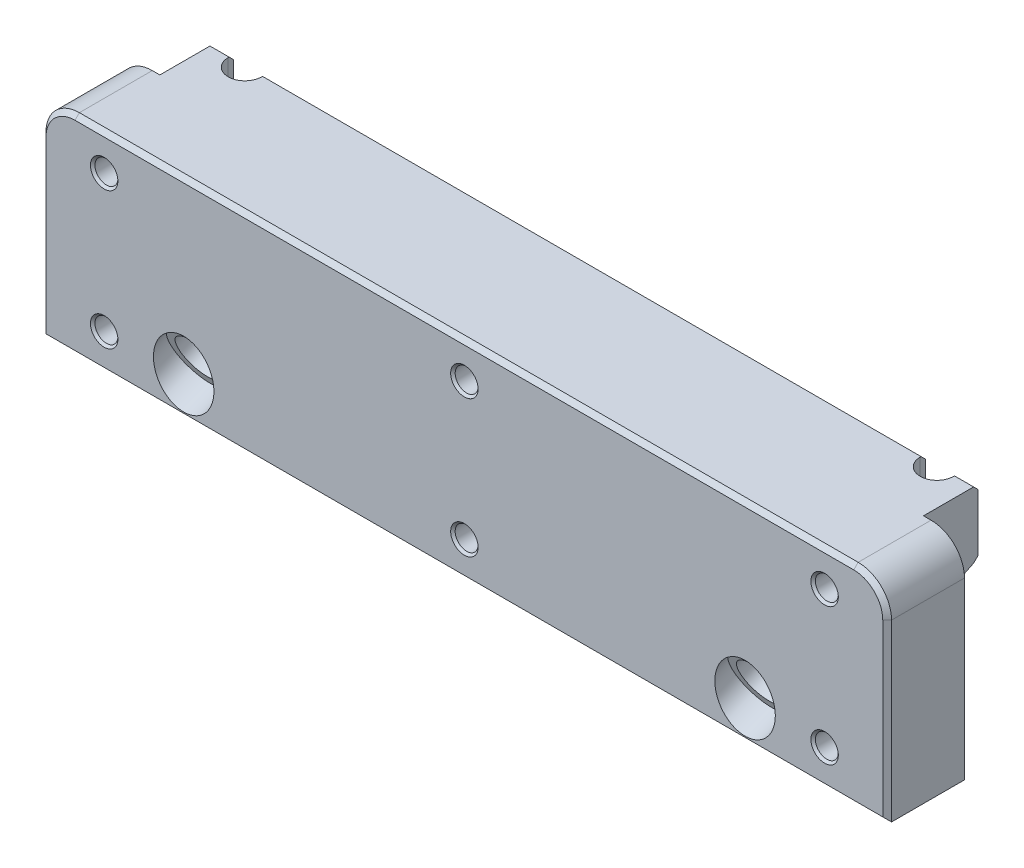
ISO-10303-21;
HEADER;
FILE_DESCRIPTION(('STEP AP214'),'2;1');
FILE_NAME('part.step','',(''),(''),'','','');
FILE_SCHEMA(('AUTOMOTIVE_DESIGN { 1 0 10303 214 1 1 1 1 }'));
ENDSEC;
DATA;
#1=APPLICATION_CONTEXT('core data for automotive mechanical design processes');
#2=APPLICATION_PROTOCOL_DEFINITION('international standard','automotive_design',2000,#1);
#3=PRODUCT_CONTEXT('',#1,'mechanical');
#4=PRODUCT('Part','Part','',(#3));
#5=PRODUCT_RELATED_PRODUCT_CATEGORY('part','',(#4));
#6=PRODUCT_DEFINITION_FORMATION('','',#4);
#7=PRODUCT_DEFINITION_CONTEXT('part definition',#1,'design');
#8=PRODUCT_DEFINITION('design','',#6,#7);
#9=PRODUCT_DEFINITION_SHAPE('','',#8);
#10=(LENGTH_UNIT() NAMED_UNIT(*) SI_UNIT(.MILLI.,.METRE.));
#11=(NAMED_UNIT(*) PLANE_ANGLE_UNIT() SI_UNIT($,.RADIAN.));
#12=(NAMED_UNIT(*) SI_UNIT($,.STERADIAN.) SOLID_ANGLE_UNIT());
#13=UNCERTAINTY_MEASURE_WITH_UNIT(LENGTH_MEASURE(1.E-05),#10,'distance_accuracy_value','');
#14=(GEOMETRIC_REPRESENTATION_CONTEXT(3) GLOBAL_UNCERTAINTY_ASSIGNED_CONTEXT((#13)) GLOBAL_UNIT_ASSIGNED_CONTEXT((#10,
#11,#12)) REPRESENTATION_CONTEXT('',''));
#15=CARTESIAN_POINT('',(0.,0.,0.));
#16=DIRECTION('',(0.,0.,1.));
#17=DIRECTION('',(1.,0.,0.));
#18=AXIS2_PLACEMENT_3D('',#15,#16,#17);
#19=CARTESIAN_POINT('',(0.,60.198,22.352));
#20=DIRECTION('',(0.,0.,-1.));
#21=DIRECTION('',(-1.,0.,0.));
#22=AXIS2_PLACEMENT_3D('',#19,#20,#21);
#23=PLANE('',#22);
#24=DIRECTION('',(0.999999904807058,-0.00043633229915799,0.));
#25=VECTOR('',#24,1.);
#26=CARTESIAN_POINT('',(3.96874962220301,49.9092683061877,22.352));
#27=LINE('',#26,#25);
#28=CARTESIAN_POINT('',(3.96900362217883,49.9092681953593,22.352));
#29=VERTEX_POINT('',#28);
#30=CARTESIAN_POINT('',(3.96874962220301,49.9092683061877,22.352));
#31=VERTEX_POINT('',#30);
#32=EDGE_CURVE('E527',#29,#31,#27,.F.);
#33=ORIENTED_EDGE('',*,*,#32,.F.);
#34=CARTESIAN_POINT('',(0.,49.911,22.352));
#35=DIRECTION('',(0.,0.,1.));
#36=DIRECTION('',(1.,0.,0.));
#37=AXIS2_PLACEMENT_3D('',#34,#35,#36);
#38=CIRCLE('',#37,3.969004);
#39=CARTESIAN_POINT('',(3.969004,49.911,22.352));
#40=VERTEX_POINT('',#39);
#41=EDGE_CURVE('E478',#40,#29,#38,.T.);
#42=ORIENTED_EDGE('',*,*,#41,.F.);
#43=DIRECTION('',(1.,0.,0.));
#44=VECTOR('',#43,1.);
#45=CARTESIAN_POINT('',(3.96875,49.911,22.352));
#46=LINE('',#45,#44);
#47=CARTESIAN_POINT('',(3.96875,49.911,22.352));
#48=VERTEX_POINT('',#47);
#49=EDGE_CURVE('E41',#40,#48,#46,.F.);
#50=ORIENTED_EDGE('',*,*,#49,.T.);
#51=CARTESIAN_POINT('',(0.,49.911,22.352));
#52=DIRECTION('',(0.,0.,-1.));
#53=DIRECTION('',(-1.,0.,0.));
#54=AXIS2_PLACEMENT_3D('',#51,#52,#53);
#55=CIRCLE('',#54,3.96875);
#56=EDGE_CURVE('E853',#48,#31,#55,.T.);
#57=ORIENTED_EDGE('',*,*,#56,.T.);
#58=EDGE_LOOP('',(#33,#42,#50,#57));
#59=FACE_BOUND('',#58,.T.);
#60=DIRECTION('',(0.999999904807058,-0.000436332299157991,0.));
#61=VECTOR('',#60,1.);
#62=CARTESIAN_POINT('',(-100.171250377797,10.2852683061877,22.352));
#63=LINE('',#62,#61);
#64=CARTESIAN_POINT('',(-100.170996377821,10.2852681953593,22.352));
#65=VERTEX_POINT('',#64);
#66=CARTESIAN_POINT('',(-100.171250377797,10.2852683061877,22.352));
#67=VERTEX_POINT('',#66);
#68=EDGE_CURVE('E2249',#65,#67,#63,.F.);
#69=ORIENTED_EDGE('',*,*,#68,.F.);
#70=CARTESIAN_POINT('',(-104.14,10.287,22.352));
#71=DIRECTION('',(0.,0.,1.));
#72=DIRECTION('',(1.,0.,0.));
#73=AXIS2_PLACEMENT_3D('',#70,#71,#72);
#74=CIRCLE('',#73,3.969004);
#75=CARTESIAN_POINT('',(-100.170996,10.287,22.352));
#76=VERTEX_POINT('',#75);
#77=EDGE_CURVE('E2387',#76,#65,#74,.T.);
#78=ORIENTED_EDGE('',*,*,#77,.F.);
#79=DIRECTION('',(1.,0.,0.));
#80=VECTOR('',#79,1.);
#81=CARTESIAN_POINT('',(-100.17125,10.287,22.352));
#82=LINE('',#81,#80);
#83=CARTESIAN_POINT('',(-100.17125,10.287,22.352));
#84=VERTEX_POINT('',#83);
#85=EDGE_CURVE('E2253',#76,#84,#82,.F.);
#86=ORIENTED_EDGE('',*,*,#85,.T.);
#87=CARTESIAN_POINT('',(-104.14,10.287,22.352));
#88=DIRECTION('',(0.,0.,-1.));
#89=DIRECTION('',(-1.,0.,0.));
#90=AXIS2_PLACEMENT_3D('',#87,#88,#89);
#91=CIRCLE('',#90,3.96875);
#92=EDGE_CURVE('E533',#84,#67,#91,.T.);
#93=ORIENTED_EDGE('',*,*,#92,.T.);
#94=EDGE_LOOP('',(#69,#78,#86,#93));
#95=FACE_BOUND('',#94,.T.);
#96=DIRECTION('',(0.999999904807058,-0.00043633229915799,0.));
#97=VECTOR('',#96,1.);
#98=CARTESIAN_POINT('',(108.108749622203,49.9092683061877,22.352));
#99=LINE('',#98,#97);
#100=CARTESIAN_POINT('',(108.109003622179,49.9092681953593,22.352));
#101=VERTEX_POINT('',#100);
#102=CARTESIAN_POINT('',(108.108749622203,49.9092683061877,22.352));
#103=VERTEX_POINT('',#102);
#104=EDGE_CURVE('E868',#101,#103,#99,.F.);
#105=ORIENTED_EDGE('',*,*,#104,.F.);
#106=CARTESIAN_POINT('',(104.14,49.911,22.352));
#107=DIRECTION('',(0.,0.,1.));
#108=DIRECTION('',(1.,0.,0.));
#109=AXIS2_PLACEMENT_3D('',#106,#107,#108);
#110=CIRCLE('',#109,3.969004);
#111=CARTESIAN_POINT('',(108.109004,49.911,22.352));
#112=VERTEX_POINT('',#111);
#113=EDGE_CURVE('E2319',#112,#101,#110,.T.);
#114=ORIENTED_EDGE('',*,*,#113,.F.);
#115=DIRECTION('',(1.,0.,0.));
#116=VECTOR('',#115,1.);
#117=CARTESIAN_POINT('',(108.10875,49.911,22.352));
#118=LINE('',#117,#116);
#119=CARTESIAN_POINT('',(108.10875,49.911,22.352));
#120=VERTEX_POINT('',#119);
#121=EDGE_CURVE('E872',#112,#120,#118,.F.);
#122=ORIENTED_EDGE('',*,*,#121,.T.);
#123=CARTESIAN_POINT('',(104.14,49.911,22.352));
#124=DIRECTION('',(0.,0.,-1.));
#125=DIRECTION('',(-1.,0.,0.));
#126=AXIS2_PLACEMENT_3D('',#123,#124,#125);
#127=CIRCLE('',#126,3.96875);
#128=EDGE_CURVE('E850',#120,#103,#127,.T.);
#129=ORIENTED_EDGE('',*,*,#128,.T.);
#130=EDGE_LOOP('',(#105,#114,#122,#129));
#131=FACE_BOUND('',#130,.T.);
#132=DIRECTION('',(0.,1.,0.));
#133=VECTOR('',#132,1.);
#134=CARTESIAN_POINT('',(120.9548,60.198,22.352));
#135=LINE('',#134,#133);
#136=CARTESIAN_POINT('',(120.9548,1.27,22.352));
#137=VERTEX_POINT('',#136);
#138=CARTESIAN_POINT('',(120.9548,50.546,22.352));
#139=VERTEX_POINT('',#138);
#140=EDGE_CURVE('E791',#137,#139,#135,.T.);
#141=ORIENTED_EDGE('',*,*,#140,.T.);
#142=CARTESIAN_POINT('',(112.5728,50.546,22.352));
#143=DIRECTION('',(0.,0.,-1.));
#144=DIRECTION('',(-1.,0.,0.));
#145=AXIS2_PLACEMENT_3D('',#142,#143,#144);
#146=CIRCLE('',#145,8.382);
#147=CARTESIAN_POINT('',(112.5728,58.928,22.352));
#148=VERTEX_POINT('',#147);
#149=EDGE_CURVE('E800',#139,#148,#146,.F.);
#150=ORIENTED_EDGE('',*,*,#149,.T.);
#151=DIRECTION('',(-1.,0.,0.));
#152=VECTOR('',#151,1.);
#153=CARTESIAN_POINT('',(0.,58.928,22.352));
#154=LINE('',#153,#152);
#155=CARTESIAN_POINT('',(-112.5728,58.928,22.352));
#156=VERTEX_POINT('',#155);
#157=EDGE_CURVE('E798',#148,#156,#154,.T.);
#158=ORIENTED_EDGE('',*,*,#157,.T.);
#159=CARTESIAN_POINT('',(-112.5728,50.546,22.352));
#160=DIRECTION('',(0.,0.,-1.));
#161=DIRECTION('',(-1.,0.,0.));
#162=AXIS2_PLACEMENT_3D('',#159,#160,#161);
#163=CIRCLE('',#162,8.382);
#164=CARTESIAN_POINT('',(-120.9548,50.546,22.352));
#165=VERTEX_POINT('',#164);
#166=EDGE_CURVE('E795',#156,#165,#163,.F.);
#167=ORIENTED_EDGE('',*,*,#166,.T.);
#168=DIRECTION('',(0.,-1.,0.));
#169=VECTOR('',#168,1.);
#170=CARTESIAN_POINT('',(-120.9548,0.,22.352));
#171=LINE('',#170,#169);
#172=CARTESIAN_POINT('',(-120.9548,1.27,22.352));
#173=VERTEX_POINT('',#172);
#174=EDGE_CURVE('E793',#165,#173,#171,.T.);
#175=ORIENTED_EDGE('',*,*,#174,.T.);
#176=DIRECTION('',(1.,0.,0.));
#177=VECTOR('',#176,1.);
#178=CARTESIAN_POINT('',(122.2248,1.27,22.352));
#179=LINE('',#178,#177);
#180=EDGE_CURVE('E789',#173,#137,#179,.T.);
#181=ORIENTED_EDGE('',*,*,#180,.T.);
#182=EDGE_LOOP('',(#141,#150,#158,#167,#175,#181));
#183=FACE_BOUND('',#182,.T.);
#184=CARTESIAN_POINT('',(-81.153,11.0867451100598,22.352));
#185=DIRECTION('',(0.,0.,-1.));
#186=DIRECTION('',(0.,1.,0.));
#187=AXIS2_PLACEMENT_3D('',#184,#185,#186);
#188=ELLIPSE('',#187,9.49218243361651,8.7376);
#189=CARTESIAN_POINT('',(-81.153,20.5789275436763,22.352));
#190=VERTEX_POINT('',#189);
#191=EDGE_CURVE('E969',#190,#190,#188,.F.);
#192=ORIENTED_EDGE('',*,*,#191,.F.);
#193=EDGE_LOOP('',(#192));
#194=FACE_BOUND('',#193,.T.);
#195=CARTESIAN_POINT('',(81.153,11.0867451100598,22.352));
#196=DIRECTION('',(0.,0.,-1.));
#197=DIRECTION('',(0.,1.,0.));
#198=AXIS2_PLACEMENT_3D('',#195,#196,#197);
#199=ELLIPSE('',#198,9.49218243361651,8.7376);
#200=CARTESIAN_POINT('',(81.153,20.5789275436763,22.352));
#201=VERTEX_POINT('',#200);
#202=EDGE_CURVE('E928',#201,#201,#199,.F.);
#203=ORIENTED_EDGE('',*,*,#202,.F.);
#204=EDGE_LOOP('',(#203));
#205=FACE_BOUND('',#204,.T.);
#206=DIRECTION('',(0.999999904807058,-0.000436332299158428,0.));
#207=VECTOR('',#206,1.);
#208=CARTESIAN_POINT('',(3.96874962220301,10.2852683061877,22.352));
#209=LINE('',#208,#207);
#210=CARTESIAN_POINT('',(3.96900362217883,10.2852681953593,22.352));
#211=VERTEX_POINT('',#210);
#212=CARTESIAN_POINT('',(3.96874962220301,10.2852683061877,22.352));
#213=VERTEX_POINT('',#212);
#214=EDGE_CURVE('E2342',#211,#213,#209,.F.);
#215=ORIENTED_EDGE('',*,*,#214,.F.);
#216=CARTESIAN_POINT('',(0.,10.287,22.352));
#217=DIRECTION('',(0.,0.,1.));
#218=DIRECTION('',(1.,0.,0.));
#219=AXIS2_PLACEMENT_3D('',#216,#217,#218);
#220=CIRCLE('',#219,3.969004);
#221=CARTESIAN_POINT('',(3.969004,10.287,22.352));
#222=VERTEX_POINT('',#221);
#223=EDGE_CURVE('E2274',#222,#211,#220,.T.);
#224=ORIENTED_EDGE('',*,*,#223,.F.);
#225=DIRECTION('',(1.,0.,0.));
#226=VECTOR('',#225,1.);
#227=CARTESIAN_POINT('',(3.96875,10.287,22.352));
#228=LINE('',#227,#226);
#229=CARTESIAN_POINT('',(3.96875,10.287,22.352));
#230=VERTEX_POINT('',#229);
#231=EDGE_CURVE('E2233',#222,#230,#228,.F.);
#232=ORIENTED_EDGE('',*,*,#231,.T.);
#233=CARTESIAN_POINT('',(0.,10.287,22.352));
#234=DIRECTION('',(0.,0.,-1.));
#235=DIRECTION('',(-1.,0.,0.));
#236=AXIS2_PLACEMENT_3D('',#233,#234,#235);
#237=CIRCLE('',#236,3.96875);
#238=EDGE_CURVE('E884',#230,#213,#237,.T.);
#239=ORIENTED_EDGE('',*,*,#238,.T.);
#240=EDGE_LOOP('',(#215,#224,#232,#239));
#241=FACE_BOUND('',#240,.T.);
#242=DIRECTION('',(0.999999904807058,-0.000436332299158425,0.));
#243=VECTOR('',#242,1.);
#244=CARTESIAN_POINT('',(108.108749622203,10.2852683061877,22.352));
#245=LINE('',#244,#243);
#246=CARTESIAN_POINT('',(108.109003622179,10.2852681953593,22.352));
#247=VERTEX_POINT('',#246);
#248=CARTESIAN_POINT('',(108.108749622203,10.2852683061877,22.352));
#249=VERTEX_POINT('',#248);
#250=EDGE_CURVE('E2216',#247,#249,#245,.F.);
#251=ORIENTED_EDGE('',*,*,#250,.F.);
#252=CARTESIAN_POINT('',(104.14,10.287,22.352));
#253=DIRECTION('',(0.,0.,1.));
#254=DIRECTION('',(1.,0.,0.));
#255=AXIS2_PLACEMENT_3D('',#252,#253,#254);
#256=CIRCLE('',#255,3.969004);
#257=CARTESIAN_POINT('',(108.109004,10.287,22.352));
#258=VERTEX_POINT('',#257);
#259=EDGE_CURVE('E2180',#258,#247,#256,.T.);
#260=ORIENTED_EDGE('',*,*,#259,.F.);
#261=DIRECTION('',(1.,0.,0.));
#262=VECTOR('',#261,1.);
#263=CARTESIAN_POINT('',(108.10875,10.287,22.352));
#264=LINE('',#263,#262);
#265=CARTESIAN_POINT('',(108.10875,10.287,22.352));
#266=VERTEX_POINT('',#265);
#267=EDGE_CURVE('E2208',#258,#266,#264,.F.);
#268=ORIENTED_EDGE('',*,*,#267,.T.);
#269=CARTESIAN_POINT('',(104.14,10.287,22.352));
#270=DIRECTION('',(0.,0.,-1.));
#271=DIRECTION('',(-1.,0.,0.));
#272=AXIS2_PLACEMENT_3D('',#269,#270,#271);
#273=CIRCLE('',#272,3.96875);
#274=EDGE_CURVE('E842',#266,#249,#273,.T.);
#275=ORIENTED_EDGE('',*,*,#274,.T.);
#276=EDGE_LOOP('',(#251,#260,#268,#275));
#277=FACE_BOUND('',#276,.T.);
#278=DIRECTION('',(0.999999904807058,-0.000436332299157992,0.));
#279=VECTOR('',#278,1.);
#280=CARTESIAN_POINT('',(-100.171250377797,49.9092683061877,22.352));
#281=LINE('',#280,#279);
#282=CARTESIAN_POINT('',(-100.170996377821,49.9092681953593,22.352));
#283=VERTEX_POINT('',#282);
#284=CARTESIAN_POINT('',(-100.171250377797,49.9092683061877,22.352));
#285=VERTEX_POINT('',#284);
#286=EDGE_CURVE('E500',#283,#285,#281,.F.);
#287=ORIENTED_EDGE('',*,*,#286,.F.);
#288=CARTESIAN_POINT('',(-104.14,49.911,22.352));
#289=DIRECTION('',(0.,0.,1.));
#290=DIRECTION('',(1.,0.,0.));
#291=AXIS2_PLACEMENT_3D('',#288,#289,#290);
#292=CIRCLE('',#291,3.969004);
#293=CARTESIAN_POINT('',(-100.170996,49.911,22.352));
#294=VERTEX_POINT('',#293);
#295=EDGE_CURVE('E562',#294,#283,#292,.T.);
#296=ORIENTED_EDGE('',*,*,#295,.F.);
#297=DIRECTION('',(1.,0.,0.));
#298=VECTOR('',#297,1.);
#299=CARTESIAN_POINT('',(-100.17125,49.911,22.352));
#300=LINE('',#299,#298);
#301=CARTESIAN_POINT('',(-100.17125,49.911,22.352));
#302=VERTEX_POINT('',#301);
#303=EDGE_CURVE('E20',#294,#302,#300,.F.);
#304=ORIENTED_EDGE('',*,*,#303,.T.);
#305=CARTESIAN_POINT('',(-104.14,49.911,22.352));
#306=DIRECTION('',(0.,0.,-1.));
#307=DIRECTION('',(-1.,0.,0.));
#308=AXIS2_PLACEMENT_3D('',#305,#306,#307);
#309=CIRCLE('',#308,3.96875);
#310=EDGE_CURVE('E530',#302,#285,#309,.T.);
#311=ORIENTED_EDGE('',*,*,#310,.T.);
#312=EDGE_LOOP('',(#287,#296,#304,#311));
#313=FACE_BOUND('',#312,.T.);
#314=ADVANCED_FACE('F16',(#59,#95,#131,#183,#194,#205,#241,#277,#313),#23,.F.);
#315=CARTESIAN_POINT('',(110.3884,60.198,-15.748));
#316=DIRECTION('',(0.,0.,1.));
#317=DIRECTION('',(1.,0.,0.));
#318=AXIS2_PLACEMENT_3D('',#315,#316,#317);
#319=PLANE('',#318);
#320=DIRECTION('',(0.,-1.,0.));
#321=VECTOR('',#320,1.);
#322=CARTESIAN_POINT('',(-104.8512,60.198,-15.748));
#323=LINE('',#322,#321);
#324=CARTESIAN_POINT('',(-104.8512,58.928,-15.748));
#325=VERTEX_POINT('',#324);
#326=CARTESIAN_POINT('',(-104.8512,42.3654504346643,-15.748));
#327=VERTEX_POINT('',#326);
#328=EDGE_CURVE('E741',#325,#327,#323,.T.);
#329=ORIENTED_EDGE('',*,*,#328,.T.);
#330=DIRECTION('',(-1.,0.,0.));
#331=VECTOR('',#330,1.);
#332=CARTESIAN_POINT('',(110.3884,42.3654504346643,-15.748));
#333=LINE('',#332,#331);
#334=CARTESIAN_POINT('',(-110.3884,42.3654504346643,-15.748));
#335=VERTEX_POINT('',#334);
#336=EDGE_CURVE('E810',#327,#335,#333,.T.);
#337=ORIENTED_EDGE('',*,*,#336,.T.);
#338=DIRECTION('',(0.,-1.,0.));
#339=VECTOR('',#338,1.);
#340=CARTESIAN_POINT('',(-110.3884,60.198,-15.748));
#341=LINE('',#340,#339);
#342=CARTESIAN_POINT('',(-110.3884,58.928,-15.748));
#343=VERTEX_POINT('',#342);
#344=EDGE_CURVE('E950',#343,#335,#341,.T.);
#345=ORIENTED_EDGE('',*,*,#344,.F.);
#346=DIRECTION('',(1.,0.,0.));
#347=VECTOR('',#346,1.);
#348=CARTESIAN_POINT('',(110.3884,58.928,-15.748));
#349=LINE('',#348,#347);
#350=EDGE_CURVE('E775',#343,#325,#349,.T.);
#351=ORIENTED_EDGE('',*,*,#350,.T.);
#352=EDGE_LOOP('',(#329,#337,#345,#351));
#353=FACE_BOUND('',#352,.T.);
#354=ADVANCED_FACE('F599',(#353),#319,.F.);
#355=CARTESIAN_POINT('',(-110.3884,60.198,0.));
#356=DIRECTION('',(-1.,0.,0.));
#357=DIRECTION('',(0.,0.,1.));
#358=AXIS2_PLACEMENT_3D('',#355,#356,#357);
#359=PLANE('',#358);
#360=ORIENTED_EDGE('',*,*,#344,.T.);
#361=DIRECTION('',(0.,0.707106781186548,-0.707106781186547));
#362=VECTOR('',#361,1.);
#363=CARTESIAN_POINT('',(-110.3884,43.4077252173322,-16.7902747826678));
#364=LINE('',#363,#362);
#365=CARTESIAN_POINT('',(-110.3884,41.101071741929,-14.4836213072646));
#366=VERTEX_POINT('',#365);
#367=EDGE_CURVE('E813',#335,#366,#364,.F.);
#368=ORIENTED_EDGE('',*,*,#367,.T.);
#369=DIRECTION('',(0.,0.438371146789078,-0.898794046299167));
#370=VECTOR('',#369,1.);
#371=CARTESIAN_POINT('',(-110.3884,39.0642896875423,-10.307599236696));
#372=LINE('',#371,#370);
#373=CARTESIAN_POINT('',(-110.3884,34.7327063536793,-1.42653728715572));
#374=VERTEX_POINT('',#373);
#375=EDGE_CURVE('E927',#374,#366,#372,.T.);
#376=ORIENTED_EDGE('',*,*,#375,.F.);
#377=CARTESIAN_POINT('',(-110.3884,32.4497694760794,-2.54));
#378=DIRECTION('',(-1.,0.,0.));
#379=DIRECTION('',(0.,0.,1.));
#380=AXIS2_PLACEMENT_3D('',#377,#378,#379);
#381=CIRCLE('',#380,2.54);
#382=CARTESIAN_POINT('',(-110.3884,32.4497694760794,0.));
#383=VERTEX_POINT('',#382);
#384=EDGE_CURVE('E750',#374,#383,#381,.F.);
#385=ORIENTED_EDGE('',*,*,#384,.T.);
#386=DIRECTION('',(0.,-1.,0.));
#387=VECTOR('',#386,1.);
#388=CARTESIAN_POINT('',(-110.3884,60.198,0.));
#389=LINE('',#388,#387);
#390=CARTESIAN_POINT('',(-110.3884,60.198,0.));
#391=VERTEX_POINT('',#390);
#392=EDGE_CURVE('E948',#391,#383,#389,.T.);
#393=ORIENTED_EDGE('',*,*,#392,.F.);
#394=DIRECTION('',(0.,0.,1.));
#395=VECTOR('',#394,1.);
#396=CARTESIAN_POINT('',(-110.3884,60.198,0.));
#397=LINE('',#396,#395);
#398=CARTESIAN_POINT('',(-110.3884,60.198,-14.478));
#399=VERTEX_POINT('',#398);
#400=EDGE_CURVE('E717',#399,#391,#397,.T.);
#401=ORIENTED_EDGE('',*,*,#400,.F.);
#402=DIRECTION('',(0.,0.707106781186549,0.707106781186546));
#403=VECTOR('',#402,1.);
#404=CARTESIAN_POINT('',(-110.3884,67.437,-7.239));
#405=LINE('',#404,#403);
#406=EDGE_CURVE('E773',#399,#343,#405,.F.);
#407=ORIENTED_EDGE('',*,*,#406,.T.);
#408=EDGE_LOOP('',(#360,#368,#376,#385,#393,#401,#407));
#409=FACE_BOUND('',#408,.T.);
#410=ADVANCED_FACE('F605',(#409),#359,.T.);
#411=CARTESIAN_POINT('',(-122.2248,60.198,22.352));
#412=DIRECTION('',(0.,-1.,0.));
#413=DIRECTION('',(0.,0.,-1.));
#414=AXIS2_PLACEMENT_3D('',#411,#412,#413);
#415=PLANE('',#414);
#416=DIRECTION('',(0.,0.,-1.));
#417=VECTOR('',#416,1.);
#418=CARTESIAN_POINT('',(110.3884,60.198,0.));
#419=LINE('',#418,#417);
#420=CARTESIAN_POINT('',(110.3884,60.198,0.));
#421=VERTEX_POINT('',#420);
#422=CARTESIAN_POINT('',(110.3884,60.198,-14.478));
#423=VERTEX_POINT('',#422);
#424=EDGE_CURVE('E938',#421,#423,#419,.T.);
#425=ORIENTED_EDGE('',*,*,#424,.T.);
#426=DIRECTION('',(-1.,0.,0.));
#427=VECTOR('',#426,1.);
#428=CARTESIAN_POINT('',(-122.2248,60.198,-14.478));
#429=LINE('',#428,#427);
#430=CARTESIAN_POINT('',(104.8512,60.198,-14.478));
#431=VERTEX_POINT('',#430);
#432=EDGE_CURVE('E763',#423,#431,#429,.T.);
#433=ORIENTED_EDGE('',*,*,#432,.T.);
#434=DIRECTION('',(0.,0.,1.));
#435=VECTOR('',#434,1.);
#436=CARTESIAN_POINT('',(104.8512,60.198,17.526));
#437=LINE('',#436,#435);
#438=CARTESIAN_POINT('',(104.8512,60.198,-14.224));
#439=VERTEX_POINT('',#438);
#440=EDGE_CURVE('E1012',#431,#439,#437,.T.);
#441=ORIENTED_EDGE('',*,*,#440,.T.);
#442=CARTESIAN_POINT('',(100.0252,60.198,-14.224));
#443=DIRECTION('',(0.,-1.,0.));
#444=DIRECTION('',(0.,0.,-1.));
#445=AXIS2_PLACEMENT_3D('',#442,#443,#444);
#446=CIRCLE('',#445,4.826);
#447=CARTESIAN_POINT('',(95.1992,60.198,-14.224));
#448=VERTEX_POINT('',#447);
#449=EDGE_CURVE('E1004',#439,#448,#446,.T.);
#450=ORIENTED_EDGE('',*,*,#449,.T.);
#451=DIRECTION('',(0.,0.,-1.));
#452=VECTOR('',#451,1.);
#453=CARTESIAN_POINT('',(95.1992,60.198,17.526));
#454=LINE('',#453,#452);
#455=CARTESIAN_POINT('',(95.1992,60.198,-14.478));
#456=VERTEX_POINT('',#455);
#457=EDGE_CURVE('E988',#448,#456,#454,.T.);
#458=ORIENTED_EDGE('',*,*,#457,.T.);
#459=DIRECTION('',(-1.,0.,0.));
#460=VECTOR('',#459,1.);
#461=CARTESIAN_POINT('',(-122.2248,60.198,-14.478));
#462=LINE('',#461,#460);
#463=CARTESIAN_POINT('',(-95.1992,60.198,-14.478));
#464=VERTEX_POINT('',#463);
#465=EDGE_CURVE('E757',#456,#464,#462,.T.);
#466=ORIENTED_EDGE('',*,*,#465,.T.);
#467=DIRECTION('',(0.,0.,1.));
#468=VECTOR('',#467,1.);
#469=CARTESIAN_POINT('',(-95.1992,60.198,17.526));
#470=LINE('',#469,#468);
#471=CARTESIAN_POINT('',(-95.1992,60.198,-14.224));
#472=VERTEX_POINT('',#471);
#473=EDGE_CURVE('E740',#464,#472,#470,.T.);
#474=ORIENTED_EDGE('',*,*,#473,.T.);
#475=CARTESIAN_POINT('',(-100.0252,60.198,-14.224));
#476=DIRECTION('',(0.,-1.,0.));
#477=DIRECTION('',(0.,0.,-1.));
#478=AXIS2_PLACEMENT_3D('',#475,#476,#477);
#479=CIRCLE('',#478,4.826);
#480=CARTESIAN_POINT('',(-104.8512,60.198,-14.224));
#481=VERTEX_POINT('',#480);
#482=EDGE_CURVE('E714',#472,#481,#479,.T.);
#483=ORIENTED_EDGE('',*,*,#482,.T.);
#484=DIRECTION('',(0.,0.,-1.));
#485=VECTOR('',#484,1.);
#486=CARTESIAN_POINT('',(-104.8512,60.198,17.526));
#487=LINE('',#486,#485);
#488=CARTESIAN_POINT('',(-104.8512,60.198,-14.478));
#489=VERTEX_POINT('',#488);
#490=EDGE_CURVE('E923',#489,#481,#487,.F.);
#491=ORIENTED_EDGE('',*,*,#490,.F.);
#492=DIRECTION('',(-1.,0.,0.));
#493=VECTOR('',#492,1.);
#494=CARTESIAN_POINT('',(-122.2248,60.198,-14.478));
#495=LINE('',#494,#493);
#496=EDGE_CURVE('E760',#489,#399,#495,.T.);
#497=ORIENTED_EDGE('',*,*,#496,.T.);
#498=ORIENTED_EDGE('',*,*,#400,.T.);
#499=DIRECTION('',(1.,0.,0.));
#500=VECTOR('',#499,1.);
#501=CARTESIAN_POINT('',(-122.2248,60.198,0.));
#502=LINE('',#501,#500);
#503=CARTESIAN_POINT('',(-112.5728,60.198,0.));
#504=VERTEX_POINT('',#503);
#505=EDGE_CURVE('E941',#504,#391,#502,.T.);
#506=ORIENTED_EDGE('',*,*,#505,.F.);
#507=DIRECTION('',(0.,0.,-1.));
#508=VECTOR('',#507,1.);
#509=CARTESIAN_POINT('',(-112.5728,60.198,22.352));
#510=LINE('',#509,#508);
#511=CARTESIAN_POINT('',(-112.5728,60.198,21.082));
#512=VERTEX_POINT('',#511);
#513=EDGE_CURVE('E947',#504,#512,#510,.F.);
#514=ORIENTED_EDGE('',*,*,#513,.T.);
#515=DIRECTION('',(1.,0.,0.));
#516=VECTOR('',#515,1.);
#517=CARTESIAN_POINT('',(-122.2248,60.198,21.082));
#518=LINE('',#517,#516);
#519=CARTESIAN_POINT('',(112.5728,60.198,21.082));
#520=VERTEX_POINT('',#519);
#521=EDGE_CURVE('E755',#512,#520,#518,.T.);
#522=ORIENTED_EDGE('',*,*,#521,.T.);
#523=DIRECTION('',(0.,0.,-1.));
#524=VECTOR('',#523,1.);
#525=CARTESIAN_POINT('',(112.5728,60.198,22.352));
#526=LINE('',#525,#524);
#527=CARTESIAN_POINT('',(112.5728,60.198,0.));
#528=VERTEX_POINT('',#527);
#529=EDGE_CURVE('E966',#520,#528,#526,.T.);
#530=ORIENTED_EDGE('',*,*,#529,.T.);
#531=DIRECTION('',(-1.,0.,0.));
#532=VECTOR('',#531,1.);
#533=CARTESIAN_POINT('',(122.2248,60.198,0.));
#534=LINE('',#533,#532);
#535=EDGE_CURVE('E935',#528,#421,#534,.T.);
#536=ORIENTED_EDGE('',*,*,#535,.T.);
#537=EDGE_LOOP('',(#425,#433,#441,#450,#458,#466,#474,#483,#491,#497,#498,#506,#514,#522,#530,#536));
#538=FACE_BOUND('',#537,.T.);
#539=ADVANCED_FACE('F614',(#538),#415,.F.);
#540=CARTESIAN_POINT('',(-104.8512,254.,-21.082));
#541=DIRECTION('',(-1.,0.,0.));
#542=DIRECTION('',(0.,0.,-1.));
#543=AXIS2_PLACEMENT_3D('',#540,#541,#542);
#544=PLANE('',#543);
#545=DIRECTION('',(0.,-0.438371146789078,0.898794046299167));
#546=VECTOR('',#545,1.);
#547=CARTESIAN_POINT('',(-104.8512,34.0369376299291,0.));
#548=LINE('',#547,#546);
#549=CARTESIAN_POINT('',(-104.8512,41.101071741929,-14.4836213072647));
#550=VERTEX_POINT('',#549);
#551=CARTESIAN_POINT('',(-104.8512,40.9744442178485,-14.2239964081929));
#552=VERTEX_POINT('',#551);
#553=EDGE_CURVE('E726',#550,#552,#548,.T.);
#554=ORIENTED_EDGE('',*,*,#553,.F.);
#555=DIRECTION('',(0.,-0.707106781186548,0.707106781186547));
#556=VECTOR('',#555,1.);
#557=CARTESIAN_POINT('',(-104.8512,42.3654504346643,-15.748));
#558=LINE('',#557,#556);
#559=EDGE_CURVE('E821',#550,#327,#558,.F.);
#560=ORIENTED_EDGE('',*,*,#559,.T.);
#561=ORIENTED_EDGE('',*,*,#328,.F.);
#562=DIRECTION('',(0.,-0.707106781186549,-0.707106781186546));
#563=VECTOR('',#562,1.);
#564=CARTESIAN_POINT('',(-104.8512,60.198,-14.478));
#565=LINE('',#564,#563);
#566=EDGE_CURVE('E777',#325,#489,#565,.F.);
#567=ORIENTED_EDGE('',*,*,#566,.T.);
#568=ORIENTED_EDGE('',*,*,#490,.T.);
#569=DIRECTION('',(0.,-1.,0.));
#570=VECTOR('',#569,1.);
#571=CARTESIAN_POINT('',(-104.8512,254.,-14.224));
#572=LINE('',#571,#570);
#573=EDGE_CURVE('E716',#481,#552,#572,.T.);
#574=ORIENTED_EDGE('',*,*,#573,.T.);
#575=EDGE_LOOP('',(#554,#560,#561,#567,#568,#574));
#576=FACE_BOUND('',#575,.T.);
#577=ADVANCED_FACE('F696',(#576),#544,.F.);
#578=DIRECTION('',(0.,-1.,0.));
#579=VECTOR('',#578,1.);
#580=CARTESIAN_POINT('',(95.1992,60.198,-15.748));
#581=LINE('',#580,#579);
#582=CARTESIAN_POINT('',(95.1992,58.928,-15.748));
#583=VERTEX_POINT('',#582);
#584=CARTESIAN_POINT('',(95.1992,42.3654504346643,-15.748));
#585=VERTEX_POINT('',#584);
#586=EDGE_CURVE('E1014',#583,#585,#581,.T.);
#587=ORIENTED_EDGE('',*,*,#586,.T.);
#588=DIRECTION('',(-1.,0.,0.));
#589=VECTOR('',#588,1.);
#590=CARTESIAN_POINT('',(110.3884,42.3654504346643,-15.748));
#591=LINE('',#590,#589);
#592=CARTESIAN_POINT('',(-95.1992,42.3654504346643,-15.748));
#593=VERTEX_POINT('',#592);
#594=EDGE_CURVE('E823',#585,#593,#591,.T.);
#595=ORIENTED_EDGE('',*,*,#594,.T.);
#596=DIRECTION('',(0.,1.,0.));
#597=VECTOR('',#596,1.);
#598=CARTESIAN_POINT('',(-95.1992,60.198,-15.748));
#599=LINE('',#598,#597);
#600=CARTESIAN_POINT('',(-95.1992,58.928,-15.748));
#601=VERTEX_POINT('',#600);
#602=EDGE_CURVE('E738',#593,#601,#599,.T.);
#603=ORIENTED_EDGE('',*,*,#602,.T.);
#604=DIRECTION('',(1.,0.,0.));
#605=VECTOR('',#604,1.);
#606=CARTESIAN_POINT('',(110.3884,58.928,-15.748));
#607=LINE('',#606,#605);
#608=EDGE_CURVE('E782',#601,#583,#607,.T.);
#609=ORIENTED_EDGE('',*,*,#608,.T.);
#610=EDGE_LOOP('',(#587,#595,#603,#609));
#611=FACE_BOUND('',#610,.T.);
#612=ADVANCED_FACE('F608',(#611),#319,.F.);
#613=CARTESIAN_POINT('',(-122.2248,0.,22.352));
#614=DIRECTION('',(0.,-1.,0.));
#615=DIRECTION('',(0.,0.,-1.));
#616=AXIS2_PLACEMENT_3D('',#613,#614,#615);
#617=PLANE('',#616);
#618=DIRECTION('',(0.,0.,-1.));
#619=VECTOR('',#618,1.);
#620=CARTESIAN_POINT('',(122.2248,0.,22.352));
#621=LINE('',#620,#619);
#622=CARTESIAN_POINT('',(122.2248,0.,21.082));
#623=VERTEX_POINT('',#622);
#624=CARTESIAN_POINT('',(122.2248,0.,0.));
#625=VERTEX_POINT('',#624);
#626=EDGE_CURVE('E934',#623,#625,#621,.T.);
#627=ORIENTED_EDGE('',*,*,#626,.F.);
#628=DIRECTION('',(-1.,0.,0.));
#629=VECTOR('',#628,1.);
#630=CARTESIAN_POINT('',(-122.2248,0.,21.082));
#631=LINE('',#630,#629);
#632=CARTESIAN_POINT('',(-122.2248,0.,21.082));
#633=VERTEX_POINT('',#632);
#634=EDGE_CURVE('E808',#623,#633,#631,.T.);
#635=ORIENTED_EDGE('',*,*,#634,.T.);
#636=DIRECTION('',(0.,0.,-1.));
#637=VECTOR('',#636,1.);
#638=CARTESIAN_POINT('',(-122.2248,0.,22.352));
#639=LINE('',#638,#637);
#640=CARTESIAN_POINT('',(-122.2248,0.,0.));
#641=VERTEX_POINT('',#640);
#642=EDGE_CURVE('E930',#633,#641,#639,.T.);
#643=ORIENTED_EDGE('',*,*,#642,.T.);
#644=DIRECTION('',(-1.,0.,0.));
#645=VECTOR('',#644,1.);
#646=CARTESIAN_POINT('',(122.2248,0.,0.));
#647=LINE('',#646,#645);
#648=EDGE_CURVE('E931',#625,#641,#647,.T.);
#649=ORIENTED_EDGE('',*,*,#648,.F.);
#650=EDGE_LOOP('',(#627,#635,#643,#649));
#651=FACE_BOUND('',#650,.T.);
#652=ADVANCED_FACE('F628',(#651),#617,.T.);
#653=CARTESIAN_POINT('',(110.3884,60.198,0.));
#654=DIRECTION('',(-1.,0.,0.));
#655=DIRECTION('',(0.,0.,1.));
#656=AXIS2_PLACEMENT_3D('',#653,#654,#655);
#657=PLANE('',#656);
#658=DIRECTION('',(0.,0.438371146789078,-0.898794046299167));
#659=VECTOR('',#658,1.);
#660=CARTESIAN_POINT('',(110.3884,39.0642896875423,-10.307599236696));
#661=LINE('',#660,#659);
#662=CARTESIAN_POINT('',(110.3884,34.7327063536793,-1.42653728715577));
#663=VERTEX_POINT('',#662);
#664=CARTESIAN_POINT('',(110.3884,41.101071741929,-14.4836213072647));
#665=VERTEX_POINT('',#664);
#666=EDGE_CURVE('E924',#663,#665,#661,.T.);
#667=ORIENTED_EDGE('',*,*,#666,.T.);
#668=DIRECTION('',(0.,-0.707106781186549,0.707106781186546));
#669=VECTOR('',#668,1.);
#670=CARTESIAN_POINT('',(110.3884,42.3654504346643,-15.748));
#671=LINE('',#670,#669);
#672=CARTESIAN_POINT('',(110.3884,42.3654504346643,-15.748));
#673=VERTEX_POINT('',#672);
#674=EDGE_CURVE('E834',#665,#673,#671,.F.);
#675=ORIENTED_EDGE('',*,*,#674,.T.);
#676=DIRECTION('',(0.,-1.,0.));
#677=VECTOR('',#676,1.);
#678=CARTESIAN_POINT('',(110.3884,60.198,-15.748));
#679=LINE('',#678,#677);
#680=CARTESIAN_POINT('',(110.3884,58.928,-15.748));
#681=VERTEX_POINT('',#680);
#682=EDGE_CURVE('E953',#681,#673,#679,.T.);
#683=ORIENTED_EDGE('',*,*,#682,.F.);
#684=DIRECTION('',(0.,-0.707106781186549,-0.707106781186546));
#685=VECTOR('',#684,1.);
#686=CARTESIAN_POINT('',(110.3884,60.198,-14.478));
#687=LINE('',#686,#685);
#688=EDGE_CURVE('E771',#681,#423,#687,.F.);
#689=ORIENTED_EDGE('',*,*,#688,.T.);
#690=ORIENTED_EDGE('',*,*,#424,.F.);
#691=DIRECTION('',(0.,-1.,0.));
#692=VECTOR('',#691,1.);
#693=CARTESIAN_POINT('',(110.3884,60.198,0.));
#694=LINE('',#693,#692);
#695=CARTESIAN_POINT('',(110.3884,32.4497694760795,0.));
#696=VERTEX_POINT('',#695);
#697=EDGE_CURVE('E956',#421,#696,#694,.T.);
#698=ORIENTED_EDGE('',*,*,#697,.T.);
#699=CARTESIAN_POINT('',(110.3884,32.4497694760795,-2.54));
#700=DIRECTION('',(-1.,0.,0.));
#701=DIRECTION('',(0.,0.,1.));
#702=AXIS2_PLACEMENT_3D('',#699,#700,#701);
#703=CIRCLE('',#702,2.54);
#704=EDGE_CURVE('E753',#696,#663,#703,.T.);
#705=ORIENTED_EDGE('',*,*,#704,.T.);
#706=EDGE_LOOP('',(#667,#675,#683,#689,#690,#698,#705));
#707=FACE_BOUND('',#706,.T.);
#708=ADVANCED_FACE('F626',(#707),#657,.F.);
#709=ORIENTED_EDGE('',*,*,#682,.T.);
#710=DIRECTION('',(-1.,0.,0.));
#711=VECTOR('',#710,1.);
#712=CARTESIAN_POINT('',(110.3884,42.3654504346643,-15.748));
#713=LINE('',#712,#711);
#714=CARTESIAN_POINT('',(104.8512,42.3654504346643,-15.748));
#715=VERTEX_POINT('',#714);
#716=EDGE_CURVE('E829',#673,#715,#713,.T.);
#717=ORIENTED_EDGE('',*,*,#716,.T.);
#718=DIRECTION('',(0.,1.,0.));
#719=VECTOR('',#718,1.);
#720=CARTESIAN_POINT('',(104.8512,60.198,-15.748));
#721=LINE('',#720,#719);
#722=CARTESIAN_POINT('',(104.8512,58.928,-15.748));
#723=VERTEX_POINT('',#722);
#724=EDGE_CURVE('E1010',#715,#723,#721,.T.);
#725=ORIENTED_EDGE('',*,*,#724,.T.);
#726=DIRECTION('',(1.,0.,0.));
#727=VECTOR('',#726,1.);
#728=CARTESIAN_POINT('',(110.3884,58.928,-15.748));
#729=LINE('',#728,#727);
#730=EDGE_CURVE('E769',#723,#681,#729,.T.);
#731=ORIENTED_EDGE('',*,*,#730,.T.);
#732=EDGE_LOOP('',(#709,#717,#725,#731));
#733=FACE_BOUND('',#732,.T.);
#734=ADVANCED_FACE('F609',(#733),#319,.F.);
#735=CARTESIAN_POINT('',(-122.2248,60.198,22.352));
#736=DIRECTION('',(-1.,0.,0.));
#737=DIRECTION('',(0.,0.,1.));
#738=AXIS2_PLACEMENT_3D('',#735,#736,#737);
#739=PLANE('',#738);
#740=ORIENTED_EDGE('',*,*,#642,.F.);
#741=DIRECTION('',(0.,1.,0.));
#742=VECTOR('',#741,1.);
#743=CARTESIAN_POINT('',(-122.2248,50.546,21.082));
#744=LINE('',#743,#742);
#745=CARTESIAN_POINT('',(-122.2248,50.546,21.082));
#746=VERTEX_POINT('',#745);
#747=EDGE_CURVE('E802',#633,#746,#744,.T.);
#748=ORIENTED_EDGE('',*,*,#747,.T.);
#749=DIRECTION('',(0.,0.,-1.));
#750=VECTOR('',#749,1.);
#751=CARTESIAN_POINT('',(-122.2248,50.546,0.));
#752=LINE('',#751,#750);
#753=CARTESIAN_POINT('',(-122.2248,50.546,0.));
#754=VERTEX_POINT('',#753);
#755=EDGE_CURVE('E993',#746,#754,#752,.T.);
#756=ORIENTED_EDGE('',*,*,#755,.T.);
#757=DIRECTION('',(0.,-1.,0.));
#758=VECTOR('',#757,1.);
#759=CARTESIAN_POINT('',(-122.2248,60.198,0.));
#760=LINE('',#759,#758);
#761=EDGE_CURVE('E944',#754,#641,#760,.T.);
#762=ORIENTED_EDGE('',*,*,#761,.T.);
#763=EDGE_LOOP('',(#740,#748,#756,#762));
#764=FACE_BOUND('',#763,.T.);
#765=ADVANCED_FACE('F624',(#764),#739,.T.);
#766=CARTESIAN_POINT('',(122.2248,60.198,0.));
#767=DIRECTION('',(0.,0.,1.));
#768=DIRECTION('',(1.,0.,0.));
#769=AXIS2_PLACEMENT_3D('',#766,#767,#768);
#770=PLANE('',#769);
#771=CARTESIAN_POINT('',(-81.153,20.5746062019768,0.));
#772=DIRECTION('',(0.,0.,1.));
#773=DIRECTION('',(0.,-1.,0.));
#774=AXIS2_PLACEMENT_3D('',#771,#772,#773);
#775=ELLIPSE('',#774,6.90528678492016,6.35635);
#776=CARTESIAN_POINT('',(-81.153,13.6693194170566,0.));
#777=VERTEX_POINT('',#776);
#778=EDGE_CURVE('E975',#777,#777,#775,.T.);
#779=ORIENTED_EDGE('',*,*,#778,.T.);
#780=EDGE_LOOP('',(#779));
#781=FACE_BOUND('',#780,.T.);
#782=CARTESIAN_POINT('',(81.153,20.5746062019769,0.));
#783=DIRECTION('',(0.,0.,1.));
#784=DIRECTION('',(0.,-1.,0.));
#785=AXIS2_PLACEMENT_3D('',#782,#783,#784);
#786=ELLIPSE('',#785,6.90528678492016,6.35635);
#787=CARTESIAN_POINT('',(81.153,13.6693194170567,0.));
#788=VERTEX_POINT('',#787);
#789=EDGE_CURVE('E979',#788,#788,#786,.T.);
#790=ORIENTED_EDGE('',*,*,#789,.T.);
#791=EDGE_LOOP('',(#790));
#792=FACE_BOUND('',#791,.T.);
#793=ORIENTED_EDGE('',*,*,#392,.T.);
#794=DIRECTION('',(-1.,0.,0.));
#795=VECTOR('',#794,1.);
#796=CARTESIAN_POINT('',(110.3884,32.4497694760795,0.));
#797=LINE('',#796,#795);
#798=EDGE_CURVE('E747',#383,#696,#797,.F.);
#799=ORIENTED_EDGE('',*,*,#798,.T.);
#800=ORIENTED_EDGE('',*,*,#697,.F.);
#801=ORIENTED_EDGE('',*,*,#535,.F.);
#802=CARTESIAN_POINT('',(112.5728,50.546,0.));
#803=DIRECTION('',(0.,0.,1.));
#804=DIRECTION('',(1.,0.,0.));
#805=AXIS2_PLACEMENT_3D('',#802,#803,#804);
#806=CIRCLE('',#805,9.652);
#807=CARTESIAN_POINT('',(122.2248,50.546,0.));
#808=VERTEX_POINT('',#807);
#809=EDGE_CURVE('E965',#528,#808,#806,.F.);
#810=ORIENTED_EDGE('',*,*,#809,.T.);
#811=DIRECTION('',(0.,-1.,0.));
#812=VECTOR('',#811,1.);
#813=CARTESIAN_POINT('',(122.2248,60.198,0.));
#814=LINE('',#813,#812);
#815=EDGE_CURVE('E937',#808,#625,#814,.T.);
#816=ORIENTED_EDGE('',*,*,#815,.T.);
#817=ORIENTED_EDGE('',*,*,#648,.T.);
#818=ORIENTED_EDGE('',*,*,#761,.F.);
#819=CARTESIAN_POINT('',(-112.5728,50.546,0.));
#820=DIRECTION('',(0.,0.,1.));
#821=DIRECTION('',(1.,0.,0.));
#822=AXIS2_PLACEMENT_3D('',#819,#820,#821);
#823=CIRCLE('',#822,9.652);
#824=EDGE_CURVE('E963',#754,#504,#823,.F.);
#825=ORIENTED_EDGE('',*,*,#824,.T.);
#826=ORIENTED_EDGE('',*,*,#505,.T.);
#827=EDGE_LOOP('',(#793,#799,#800,#801,#810,#816,#817,#818,#825,#826));
#828=FACE_BOUND('',#827,.T.);
#829=ADVANCED_FACE('F620',(#781,#792,#828),#770,.F.);
#830=CARTESIAN_POINT('',(122.2248,60.198,22.352));
#831=DIRECTION('',(-1.,0.,0.));
#832=DIRECTION('',(0.,0.,1.));
#833=AXIS2_PLACEMENT_3D('',#830,#831,#832);
#834=PLANE('',#833);
#835=DIRECTION('',(0.,0.,-1.));
#836=VECTOR('',#835,1.);
#837=CARTESIAN_POINT('',(122.2248,50.546,22.352));
#838=LINE('',#837,#836);
#839=CARTESIAN_POINT('',(122.2248,50.546,21.082));
#840=VERTEX_POINT('',#839);
#841=EDGE_CURVE('E968',#808,#840,#838,.F.);
#842=ORIENTED_EDGE('',*,*,#841,.T.);
#843=DIRECTION('',(0.,-1.,0.));
#844=VECTOR('',#843,1.);
#845=CARTESIAN_POINT('',(122.2248,60.198,21.082));
#846=LINE('',#845,#844);
#847=EDGE_CURVE('E804',#840,#623,#846,.T.);
#848=ORIENTED_EDGE('',*,*,#847,.T.);
#849=ORIENTED_EDGE('',*,*,#626,.T.);
#850=ORIENTED_EDGE('',*,*,#815,.F.);
#851=EDGE_LOOP('',(#842,#848,#849,#850));
#852=FACE_BOUND('',#851,.T.);
#853=ADVANCED_FACE('F616',(#852),#834,.F.);
#854=CARTESIAN_POINT('',(465.898994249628,34.0369376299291,0.));
#855=DIRECTION('',(0.,0.898794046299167,0.438371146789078));
#856=DIRECTION('',(0.,-0.438371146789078,0.898794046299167));
#857=AXIS2_PLACEMENT_3D('',#854,#855,#856);
#858=PLANE('',#857);
#859=ORIENTED_EDGE('',*,*,#375,.T.);
#860=DIRECTION('',(1.,0.,0.));
#861=VECTOR('',#860,1.);
#862=CARTESIAN_POINT('',(465.898994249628,41.101071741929,-14.4836213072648));
#863=LINE('',#862,#861);
#864=EDGE_CURVE('E819',#366,#550,#863,.T.);
#865=ORIENTED_EDGE('',*,*,#864,.T.);
#866=ORIENTED_EDGE('',*,*,#553,.T.);
#867=CARTESIAN_POINT('',(-100.0252,40.9744459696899,-14.224));
#868=DIRECTION('',(0.,0.898794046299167,0.438371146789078));
#869=DIRECTION('',(0.,-0.438371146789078,0.898794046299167));
#870=AXIS2_PLACEMENT_3D('',#867,#868,#869);
#871=ELLIPSE('',#870,5.36941696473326,4.826);
#872=CARTESIAN_POINT('',(-95.1992,40.9744441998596,-14.2239963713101));
#873=VERTEX_POINT('',#872);
#874=EDGE_CURVE('E712',#552,#873,#871,.T.);
#875=ORIENTED_EDGE('',*,*,#874,.T.);
#876=DIRECTION('',(0.,0.438371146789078,-0.898794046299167));
#877=VECTOR('',#876,1.);
#878=CARTESIAN_POINT('',(-95.1992,34.0369376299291,0.));
#879=LINE('',#878,#877);
#880=CARTESIAN_POINT('',(-95.1992,41.101071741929,-14.4836213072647));
#881=VERTEX_POINT('',#880);
#882=EDGE_CURVE('E720',#873,#881,#879,.T.);
#883=ORIENTED_EDGE('',*,*,#882,.T.);
#884=DIRECTION('',(1.,0.,0.));
#885=VECTOR('',#884,1.);
#886=CARTESIAN_POINT('',(465.898994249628,41.101071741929,-14.4836213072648));
#887=LINE('',#886,#885);
#888=CARTESIAN_POINT('',(95.1992,41.101071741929,-14.4836213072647));
#889=VERTEX_POINT('',#888);
#890=EDGE_CURVE('E817',#881,#889,#887,.T.);
#891=ORIENTED_EDGE('',*,*,#890,.T.);
#892=DIRECTION('',(0.,-0.438371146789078,0.898794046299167));
#893=VECTOR('',#892,1.);
#894=CARTESIAN_POINT('',(95.1992,34.0369376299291,0.));
#895=LINE('',#894,#893);
#896=CARTESIAN_POINT('',(95.1992,40.9744441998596,-14.2239963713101));
#897=VERTEX_POINT('',#896);
#898=EDGE_CURVE('E731',#889,#897,#895,.T.);
#899=ORIENTED_EDGE('',*,*,#898,.T.);
#900=CARTESIAN_POINT('',(100.0252,40.9744459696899,-14.224));
#901=DIRECTION('',(0.,0.898794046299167,0.438371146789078));
#902=DIRECTION('',(0.,-0.438371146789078,0.898794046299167));
#903=AXIS2_PLACEMENT_3D('',#900,#901,#902);
#904=ELLIPSE('',#903,5.36941696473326,4.826);
#905=CARTESIAN_POINT('',(104.8512,40.9744442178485,-14.2239964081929));
#906=VERTEX_POINT('',#905);
#907=EDGE_CURVE('E997',#897,#906,#904,.T.);
#908=ORIENTED_EDGE('',*,*,#907,.T.);
#909=DIRECTION('',(0.,0.438371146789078,-0.898794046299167));
#910=VECTOR('',#909,1.);
#911=CARTESIAN_POINT('',(104.8512,34.0369376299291,0.));
#912=LINE('',#911,#910);
#913=CARTESIAN_POINT('',(104.8512,41.101071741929,-14.4836213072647));
#914=VERTEX_POINT('',#913);
#915=EDGE_CURVE('E734',#906,#914,#912,.T.);
#916=ORIENTED_EDGE('',*,*,#915,.T.);
#917=DIRECTION('',(1.,0.,0.));
#918=VECTOR('',#917,1.);
#919=CARTESIAN_POINT('',(465.898994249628,41.101071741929,-14.4836213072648));
#920=LINE('',#919,#918);
#921=EDGE_CURVE('E815',#914,#665,#920,.T.);
#922=ORIENTED_EDGE('',*,*,#921,.T.);
#923=ORIENTED_EDGE('',*,*,#666,.F.);
#924=DIRECTION('',(-1.,0.,0.));
#925=VECTOR('',#924,1.);
#926=CARTESIAN_POINT('',(-110.3884,34.7327063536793,-1.42653728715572));
#927=LINE('',#926,#925);
#928=EDGE_CURVE('E725',#663,#374,#927,.T.);
#929=ORIENTED_EDGE('',*,*,#928,.T.);
#930=EDGE_LOOP('',(#859,#865,#866,#875,#883,#891,#899,#908,#916,#922,#923,#929));
#931=FACE_BOUND('',#930,.T.);
#932=ADVANCED_FACE('F619',(#931),#858,.F.);
#933=CARTESIAN_POINT('',(81.153,2.47865266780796,42.6313949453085));
#934=DIRECTION('',(0.,0.390731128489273,-0.92050485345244));
#935=DIRECTION('',(0.,0.92050485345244,0.390731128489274));
#936=AXIS2_PLACEMENT_3D('',#933,#934,#935);
#937=CYLINDRICAL_SURFACE('',#936,8.7376);
#938=CARTESIAN_POINT('',(81.153,12.9229830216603,18.0260945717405));
#939=DIRECTION('',(0.,-0.390731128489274,0.920504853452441));
#940=DIRECTION('',(0.,-0.92050485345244,-0.390731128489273));
#941=AXIS2_PLACEMENT_3D('',#938,#939,#940);
#942=CIRCLE('',#941,8.7376);
#943=CARTESIAN_POINT('',(81.153,4.8799798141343,14.6120422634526));
#944=VERTEX_POINT('',#943);
#945=EDGE_CURVE('E962',#944,#944,#942,.T.);
#946=ORIENTED_EDGE('',*,*,#945,.F.);
#947=EDGE_LOOP('',(#946));
#948=FACE_BOUND('',#947,.T.);
#949=ORIENTED_EDGE('',*,*,#202,.T.);
#950=EDGE_LOOP('',(#949));
#951=FACE_BOUND('',#950,.T.);
#952=ADVANCED_FACE('F653',(#948,#951),#937,.F.);
#953=CARTESIAN_POINT('',(81.153,12.9229830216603,18.0260945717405));
#954=DIRECTION('',(0.,-0.390731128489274,0.920504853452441));
#955=DIRECTION('',(0.,-0.92050485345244,-0.390731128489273));
#956=AXIS2_PLACEMENT_3D('',#953,#954,#955);
#957=PLANE('',#956);
#958=CARTESIAN_POINT('',(81.153,12.9229830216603,18.0260945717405));
#959=DIRECTION('',(0.,-0.390731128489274,0.920504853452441));
#960=DIRECTION('',(0.,-0.92050485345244,-0.390731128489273));
#961=AXIS2_PLACEMENT_3D('',#958,#959,#960);
#962=CIRCLE('',#961,6.35635);
#963=CARTESIAN_POINT('',(81.153,7.0719319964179,15.5424707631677));
#964=VERTEX_POINT('',#963);
#965=EDGE_CURVE('E972',#964,#964,#962,.T.);
#966=ORIENTED_EDGE('',*,*,#965,.F.);
#967=EDGE_LOOP('',(#966));
#968=FACE_BOUND('',#967,.T.);
#969=ORIENTED_EDGE('',*,*,#945,.T.);
#970=EDGE_LOOP('',(#969));
#971=FACE_BOUND('',#970,.T.);
#972=ADVANCED_FACE('F649',(#968,#971),#957,.T.);
#973=CARTESIAN_POINT('',(81.153,22.327793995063,-4.13025161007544));
#974=DIRECTION('',(0.,-0.390731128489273,0.92050485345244));
#975=DIRECTION('',(0.,-0.92050485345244,-0.390731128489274));
#976=AXIS2_PLACEMENT_3D('',#973,#974,#975);
#977=CYLINDRICAL_SURFACE('',#976,6.35635);
#978=ORIENTED_EDGE('',*,*,#965,.T.);
#979=EDGE_LOOP('',(#978));
#980=FACE_BOUND('',#979,.T.);
#981=ORIENTED_EDGE('',*,*,#789,.F.);
#982=EDGE_LOOP('',(#981));
#983=FACE_BOUND('',#982,.T.);
#984=ADVANCED_FACE('F645',(#980,#983),#977,.F.);
#985=CARTESIAN_POINT('',(112.5728,50.546,22.352));
#986=DIRECTION('',(0.,0.,-1.));
#987=DIRECTION('',(-1.,0.,0.));
#988=AXIS2_PLACEMENT_3D('',#985,#986,#987);
#989=CYLINDRICAL_SURFACE('',#988,9.652);
#990=ORIENTED_EDGE('',*,*,#529,.F.);
#991=CARTESIAN_POINT('',(112.5728,50.546,21.082));
#992=DIRECTION('',(0.,0.,-1.));
#993=DIRECTION('',(-1.,0.,0.));
#994=AXIS2_PLACEMENT_3D('',#991,#992,#993);
#995=CIRCLE('',#994,9.652);
#996=EDGE_CURVE('E806',#520,#840,#995,.T.);
#997=ORIENTED_EDGE('',*,*,#996,.T.);
#998=ORIENTED_EDGE('',*,*,#841,.F.);
#999=ORIENTED_EDGE('',*,*,#809,.F.);
#1000=EDGE_LOOP('',(#990,#997,#998,#999));
#1001=FACE_BOUND('',#1000,.T.);
#1002=ADVANCED_FACE('F648',(#1001),#989,.T.);
#1003=CARTESIAN_POINT('',(-112.5728,50.546,22.352));
#1004=DIRECTION('',(0.,0.,1.));
#1005=DIRECTION('',(1.,0.,0.));
#1006=AXIS2_PLACEMENT_3D('',#1003,#1004,#1005);
#1007=CYLINDRICAL_SURFACE('',#1006,9.652);
#1008=ORIENTED_EDGE('',*,*,#755,.F.);
#1009=CARTESIAN_POINT('',(-112.5728,50.546,21.082));
#1010=DIRECTION('',(0.,0.,-1.));
#1011=DIRECTION('',(-1.,0.,0.));
#1012=AXIS2_PLACEMENT_3D('',#1009,#1010,#1011);
#1013=CIRCLE('',#1012,9.652);
#1014=EDGE_CURVE('E786',#746,#512,#1013,.T.);
#1015=ORIENTED_EDGE('',*,*,#1014,.T.);
#1016=ORIENTED_EDGE('',*,*,#513,.F.);
#1017=ORIENTED_EDGE('',*,*,#824,.F.);
#1018=EDGE_LOOP('',(#1008,#1015,#1016,#1017));
#1019=FACE_BOUND('',#1018,.T.);
#1020=ADVANCED_FACE('F1049',(#1019),#1007,.T.);
#1021=CARTESIAN_POINT('',(-81.153,2.47865266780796,42.6313949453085));
#1022=DIRECTION('',(0.,0.390731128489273,-0.92050485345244));
#1023=DIRECTION('',(0.,0.92050485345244,0.390731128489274));
#1024=AXIS2_PLACEMENT_3D('',#1021,#1022,#1023);
#1025=CYLINDRICAL_SURFACE('',#1024,8.7376);
#1026=CARTESIAN_POINT('',(-81.153,12.9229830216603,18.0260945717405));
#1027=DIRECTION('',(0.,-0.390731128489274,0.920504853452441));
#1028=DIRECTION('',(0.,-0.92050485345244,-0.390731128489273));
#1029=AXIS2_PLACEMENT_3D('',#1026,#1027,#1028);
#1030=CIRCLE('',#1029,8.7376);
#1031=CARTESIAN_POINT('',(-81.153,4.8799798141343,14.6120422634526));
#1032=VERTEX_POINT('',#1031);
#1033=EDGE_CURVE('E973',#1032,#1032,#1030,.F.);
#1034=ORIENTED_EDGE('',*,*,#1033,.T.);
#1035=EDGE_LOOP('',(#1034));
#1036=FACE_BOUND('',#1035,.T.);
#1037=ORIENTED_EDGE('',*,*,#191,.T.);
#1038=EDGE_LOOP('',(#1037));
#1039=FACE_BOUND('',#1038,.T.);
#1040=ADVANCED_FACE('F657',(#1036,#1039),#1025,.F.);
#1041=CARTESIAN_POINT('',(-81.153,12.9229830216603,18.0260945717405));
#1042=DIRECTION('',(0.,-0.390731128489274,0.920504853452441));
#1043=DIRECTION('',(0.,-0.92050485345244,-0.390731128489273));
#1044=AXIS2_PLACEMENT_3D('',#1041,#1042,#1043);
#1045=PLANE('',#1044);
#1046=CARTESIAN_POINT('',(-81.153,12.9229830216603,18.0260945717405));
#1047=DIRECTION('',(0.,-0.390731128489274,0.920504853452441));
#1048=DIRECTION('',(0.,-0.92050485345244,-0.390731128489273));
#1049=AXIS2_PLACEMENT_3D('',#1046,#1047,#1048);
#1050=CIRCLE('',#1049,6.35635);
#1051=CARTESIAN_POINT('',(-81.153,7.0719319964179,15.5424707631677));
#1052=VERTEX_POINT('',#1051);
#1053=EDGE_CURVE('E978',#1052,#1052,#1050,.T.);
#1054=ORIENTED_EDGE('',*,*,#1053,.F.);
#1055=EDGE_LOOP('',(#1054));
#1056=FACE_BOUND('',#1055,.T.);
#1057=ORIENTED_EDGE('',*,*,#1033,.F.);
#1058=EDGE_LOOP('',(#1057));
#1059=FACE_BOUND('',#1058,.T.);
#1060=ADVANCED_FACE('F643',(#1056,#1059),#1045,.T.);
#1061=CARTESIAN_POINT('',(-81.153,22.327793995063,-4.13025161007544));
#1062=DIRECTION('',(0.,-0.390731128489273,0.92050485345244));
#1063=DIRECTION('',(0.,-0.92050485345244,-0.390731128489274));
#1064=AXIS2_PLACEMENT_3D('',#1061,#1062,#1063);
#1065=CYLINDRICAL_SURFACE('',#1064,6.35635);
#1066=ORIENTED_EDGE('',*,*,#1053,.T.);
#1067=EDGE_LOOP('',(#1066));
#1068=FACE_BOUND('',#1067,.T.);
#1069=ORIENTED_EDGE('',*,*,#778,.F.);
#1070=EDGE_LOOP('',(#1069));
#1071=FACE_BOUND('',#1070,.T.);
#1072=ADVANCED_FACE('F639',(#1068,#1071),#1065,.F.);
#1073=CARTESIAN_POINT('',(95.1992,254.,-14.224));
#1074=DIRECTION('',(-1.,0.,0.));
#1075=DIRECTION('',(0.,0.,1.));
#1076=AXIS2_PLACEMENT_3D('',#1073,#1074,#1075);
#1077=PLANE('',#1076);
#1078=ORIENTED_EDGE('',*,*,#898,.F.);
#1079=DIRECTION('',(0.,-0.707106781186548,0.707106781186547));
#1080=VECTOR('',#1079,1.);
#1081=CARTESIAN_POINT('',(95.1992,42.3654504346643,-15.748));
#1082=LINE('',#1081,#1080);
#1083=EDGE_CURVE('E827',#889,#585,#1082,.F.);
#1084=ORIENTED_EDGE('',*,*,#1083,.T.);
#1085=ORIENTED_EDGE('',*,*,#586,.F.);
#1086=DIRECTION('',(0.,-0.707106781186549,-0.707106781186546));
#1087=VECTOR('',#1086,1.);
#1088=CARTESIAN_POINT('',(95.1992,60.198,-14.478));
#1089=LINE('',#1088,#1087);
#1090=EDGE_CURVE('E784',#583,#456,#1089,.F.);
#1091=ORIENTED_EDGE('',*,*,#1090,.T.);
#1092=ORIENTED_EDGE('',*,*,#457,.F.);
#1093=DIRECTION('',(0.,-1.,0.));
#1094=VECTOR('',#1093,1.);
#1095=CARTESIAN_POINT('',(95.1992,254.,-14.224));
#1096=LINE('',#1095,#1094);
#1097=EDGE_CURVE('E743',#448,#897,#1096,.T.);
#1098=ORIENTED_EDGE('',*,*,#1097,.T.);
#1099=EDGE_LOOP('',(#1078,#1084,#1085,#1091,#1092,#1098));
#1100=FACE_BOUND('',#1099,.T.);
#1101=ADVANCED_FACE('F642',(#1100),#1077,.F.);
#1102=CARTESIAN_POINT('',(104.8512,254.,-21.082));
#1103=DIRECTION('',(1.,0.,0.));
#1104=DIRECTION('',(0.,0.,-1.));
#1105=AXIS2_PLACEMENT_3D('',#1102,#1103,#1104);
#1106=PLANE('',#1105);
#1107=ORIENTED_EDGE('',*,*,#724,.F.);
#1108=DIRECTION('',(0.,0.707106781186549,-0.707106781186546));
#1109=VECTOR('',#1108,1.);
#1110=CARTESIAN_POINT('',(104.8512,42.3654504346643,-15.748));
#1111=LINE('',#1110,#1109);
#1112=EDGE_CURVE('E832',#715,#914,#1111,.F.);
#1113=ORIENTED_EDGE('',*,*,#1112,.T.);
#1114=ORIENTED_EDGE('',*,*,#915,.F.);
#1115=DIRECTION('',(0.,-1.,0.));
#1116=VECTOR('',#1115,1.);
#1117=CARTESIAN_POINT('',(104.8512,254.,-14.224));
#1118=LINE('',#1117,#1116);
#1119=EDGE_CURVE('E1003',#439,#906,#1118,.T.);
#1120=ORIENTED_EDGE('',*,*,#1119,.F.);
#1121=ORIENTED_EDGE('',*,*,#440,.F.);
#1122=DIRECTION('',(0.,0.707106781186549,0.707106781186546));
#1123=VECTOR('',#1122,1.);
#1124=CARTESIAN_POINT('',(104.8512,60.198,-14.478));
#1125=LINE('',#1124,#1123);
#1126=EDGE_CURVE('E766',#431,#723,#1125,.F.);
#1127=ORIENTED_EDGE('',*,*,#1126,.T.);
#1128=EDGE_LOOP('',(#1107,#1113,#1114,#1120,#1121,#1127));
#1129=FACE_BOUND('',#1128,.T.);
#1130=ADVANCED_FACE('F687',(#1129),#1106,.F.);
#1131=CARTESIAN_POINT('',(100.0252,254.,-14.224));
#1132=DIRECTION('',(0.,-1.,0.));
#1133=DIRECTION('',(0.,0.,-1.));
#1134=AXIS2_PLACEMENT_3D('',#1131,#1132,#1133);
#1135=CYLINDRICAL_SURFACE('',#1134,4.826);
#1136=ORIENTED_EDGE('',*,*,#1119,.T.);
#1137=ORIENTED_EDGE('',*,*,#907,.F.);
#1138=ORIENTED_EDGE('',*,*,#1097,.F.);
#1139=ORIENTED_EDGE('',*,*,#449,.F.);
#1140=EDGE_LOOP('',(#1136,#1137,#1138,#1139));
#1141=FACE_BOUND('',#1140,.T.);
#1142=ADVANCED_FACE('F691',(#1141),#1135,.F.);
#1143=CARTESIAN_POINT('',(-95.1992,254.,-14.224));
#1144=DIRECTION('',(1.,0.,0.));
#1145=DIRECTION('',(0.,0.,1.));
#1146=AXIS2_PLACEMENT_3D('',#1143,#1144,#1145);
#1147=PLANE('',#1146);
#1148=ORIENTED_EDGE('',*,*,#602,.F.);
#1149=DIRECTION('',(0.,0.707106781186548,-0.707106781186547));
#1150=VECTOR('',#1149,1.);
#1151=CARTESIAN_POINT('',(-95.1992,42.3654504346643,-15.748));
#1152=LINE('',#1151,#1150);
#1153=EDGE_CURVE('E722',#593,#881,#1152,.F.);
#1154=ORIENTED_EDGE('',*,*,#1153,.T.);
#1155=ORIENTED_EDGE('',*,*,#882,.F.);
#1156=DIRECTION('',(0.,-1.,0.));
#1157=VECTOR('',#1156,1.);
#1158=CARTESIAN_POINT('',(-95.1992,254.,-14.224));
#1159=LINE('',#1158,#1157);
#1160=EDGE_CURVE('E708',#472,#873,#1159,.T.);
#1161=ORIENTED_EDGE('',*,*,#1160,.F.);
#1162=ORIENTED_EDGE('',*,*,#473,.F.);
#1163=DIRECTION('',(0.,0.707106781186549,0.707106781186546));
#1164=VECTOR('',#1163,1.);
#1165=CARTESIAN_POINT('',(-95.1992,60.198,-14.478));
#1166=LINE('',#1165,#1164);
#1167=EDGE_CURVE('E779',#464,#601,#1166,.F.);
#1168=ORIENTED_EDGE('',*,*,#1167,.T.);
#1169=EDGE_LOOP('',(#1148,#1154,#1155,#1161,#1162,#1168));
#1170=FACE_BOUND('',#1169,.T.);
#1171=ADVANCED_FACE('F18',(#1170),#1147,.F.);
#1172=CARTESIAN_POINT('',(-100.0252,254.,-14.224));
#1173=DIRECTION('',(0.,-1.,0.));
#1174=DIRECTION('',(0.,0.,-1.));
#1175=AXIS2_PLACEMENT_3D('',#1172,#1173,#1174);
#1176=CYLINDRICAL_SURFACE('',#1175,4.826);
#1177=ORIENTED_EDGE('',*,*,#1160,.T.);
#1178=ORIENTED_EDGE('',*,*,#874,.F.);
#1179=ORIENTED_EDGE('',*,*,#573,.F.);
#1180=ORIENTED_EDGE('',*,*,#482,.F.);
#1181=EDGE_LOOP('',(#1177,#1178,#1179,#1180));
#1182=FACE_BOUND('',#1181,.T.);
#1183=ADVANCED_FACE('F669',(#1182),#1176,.F.);
#1184=CARTESIAN_POINT('',(-104.14,49.911,5.1816));
#1185=DIRECTION('',(0.,0.,1.));
#1186=DIRECTION('',(1.,0.,0.));
#1187=AXIS2_PLACEMENT_3D('',#1184,#1185,#1186);
#1188=CYLINDRICAL_SURFACE('',#1187,3.3147);
#1189=CARTESIAN_POINT('',(-104.14,49.911,21.69795));
#1190=DIRECTION('',(0.,0.,-1.));
#1191=DIRECTION('',(-1.,0.,0.));
#1192=AXIS2_PLACEMENT_3D('',#1189,#1190,#1191);
#1193=CIRCLE('',#1192,3.3147);
#1194=CARTESIAN_POINT('',(-107.4547,49.911,21.69795));
#1195=VERTEX_POINT('',#1194);
#1196=EDGE_CURVE('E10',#1195,#1195,#1193,.F.);
#1197=ORIENTED_EDGE('',*,*,#1196,.T.);
#1198=EDGE_LOOP('',(#1197));
#1199=FACE_BOUND('',#1198,.T.);
#1200=CARTESIAN_POINT('',(-104.14,49.911,5.207));
#1201=DIRECTION('',(0.,0.,-1.));
#1202=DIRECTION('',(-1.,0.,0.));
#1203=AXIS2_PLACEMENT_3D('',#1200,#1201,#1202);
#1204=CIRCLE('',#1203,3.3147);
#1205=CARTESIAN_POINT('',(-107.4547,49.911,5.207));
#1206=VERTEX_POINT('',#1205);
#1207=EDGE_CURVE('E920',#1206,#1206,#1204,.T.);
#1208=ORIENTED_EDGE('',*,*,#1207,.T.);
#1209=EDGE_LOOP('',(#1208));
#1210=FACE_BOUND('',#1209,.T.);
#1211=ADVANCED_FACE('F665',(#1199,#1210),#1188,.F.);
#1212=CARTESIAN_POINT('',(0.,49.911,5.1816));
#1213=DIRECTION('',(0.,0.,1.));
#1214=DIRECTION('',(1.,0.,0.));
#1215=AXIS2_PLACEMENT_3D('',#1212,#1213,#1214);
#1216=CYLINDRICAL_SURFACE('',#1215,3.3147);
#1217=CARTESIAN_POINT('',(0.,49.911,21.69795));
#1218=DIRECTION('',(0.,0.,-1.));
#1219=DIRECTION('',(-1.,0.,0.));
#1220=AXIS2_PLACEMENT_3D('',#1217,#1218,#1219);
#1221=CIRCLE('',#1220,3.3147);
#1222=CARTESIAN_POINT('',(-3.3147,49.911,21.69795));
#1223=VERTEX_POINT('',#1222);
#1224=EDGE_CURVE('E841',#1223,#1223,#1221,.F.);
#1225=ORIENTED_EDGE('',*,*,#1224,.T.);
#1226=EDGE_LOOP('',(#1225));
#1227=FACE_BOUND('',#1226,.T.);
#1228=CARTESIAN_POINT('',(0.,49.911,5.207));
#1229=DIRECTION('',(0.,0.,-1.));
#1230=DIRECTION('',(-1.,0.,0.));
#1231=AXIS2_PLACEMENT_3D('',#1228,#1229,#1230);
#1232=CIRCLE('',#1231,3.3147);
#1233=CARTESIAN_POINT('',(-3.3147,49.911,5.207));
#1234=VERTEX_POINT('',#1233);
#1235=EDGE_CURVE('E911',#1234,#1234,#1232,.T.);
#1236=ORIENTED_EDGE('',*,*,#1235,.T.);
#1237=EDGE_LOOP('',(#1236));
#1238=FACE_BOUND('',#1237,.T.);
#1239=ADVANCED_FACE('F668',(#1227,#1238),#1216,.F.);
#1240=CARTESIAN_POINT('',(104.14,10.287,5.1816));
#1241=DIRECTION('',(0.,0.,1.));
#1242=DIRECTION('',(1.,0.,0.));
#1243=AXIS2_PLACEMENT_3D('',#1240,#1241,#1242);
#1244=CYLINDRICAL_SURFACE('',#1243,3.3147);
#1245=CARTESIAN_POINT('',(104.14,10.287,21.69795));
#1246=DIRECTION('',(0.,0.,-1.));
#1247=DIRECTION('',(-1.,0.,0.));
#1248=AXIS2_PLACEMENT_3D('',#1245,#1246,#1247);
#1249=CIRCLE('',#1248,3.3147);
#1250=CARTESIAN_POINT('',(100.8253,10.287,21.69795));
#1251=VERTEX_POINT('',#1250);
#1252=EDGE_CURVE('E534',#1251,#1251,#1249,.F.);
#1253=ORIENTED_EDGE('',*,*,#1252,.T.);
#1254=EDGE_LOOP('',(#1253));
#1255=FACE_BOUND('',#1254,.T.);
#1256=CARTESIAN_POINT('',(104.14,10.287,5.207));
#1257=DIRECTION('',(0.,0.,-1.));
#1258=DIRECTION('',(-1.,0.,0.));
#1259=AXIS2_PLACEMENT_3D('',#1256,#1257,#1258);
#1260=CIRCLE('',#1259,3.3147);
#1261=CARTESIAN_POINT('',(100.8253,10.287,5.207));
#1262=VERTEX_POINT('',#1261);
#1263=EDGE_CURVE('E905',#1262,#1262,#1260,.T.);
#1264=ORIENTED_EDGE('',*,*,#1263,.T.);
#1265=EDGE_LOOP('',(#1264));
#1266=FACE_BOUND('',#1265,.T.);
#1267=ADVANCED_FACE('F673',(#1255,#1266),#1244,.F.);
#1268=CARTESIAN_POINT('',(0.,10.287,5.1816));
#1269=DIRECTION('',(0.,0.,1.));
#1270=DIRECTION('',(1.,0.,0.));
#1271=AXIS2_PLACEMENT_3D('',#1268,#1269,#1270);
#1272=CYLINDRICAL_SURFACE('',#1271,3.3147);
#1273=CARTESIAN_POINT('',(0.,10.287,21.69795));
#1274=DIRECTION('',(0.,0.,-1.));
#1275=DIRECTION('',(-1.,0.,0.));
#1276=AXIS2_PLACEMENT_3D('',#1273,#1274,#1275);
#1277=CIRCLE('',#1276,3.3147);
#1278=CARTESIAN_POINT('',(-3.3147,10.287,21.69795));
#1279=VERTEX_POINT('',#1278);
#1280=EDGE_CURVE('E845',#1279,#1279,#1277,.F.);
#1281=ORIENTED_EDGE('',*,*,#1280,.T.);
#1282=EDGE_LOOP('',(#1281));
#1283=FACE_BOUND('',#1282,.T.);
#1284=CARTESIAN_POINT('',(0.,10.287,5.207));
#1285=DIRECTION('',(0.,0.,-1.));
#1286=DIRECTION('',(-1.,0.,0.));
#1287=AXIS2_PLACEMENT_3D('',#1284,#1285,#1286);
#1288=CIRCLE('',#1287,3.3147);
#1289=CARTESIAN_POINT('',(-3.3147,10.287,5.207));
#1290=VERTEX_POINT('',#1289);
#1291=EDGE_CURVE('E914',#1290,#1290,#1288,.T.);
#1292=ORIENTED_EDGE('',*,*,#1291,.T.);
#1293=EDGE_LOOP('',(#1292));
#1294=FACE_BOUND('',#1293,.T.);
#1295=ADVANCED_FACE('F675',(#1283,#1294),#1272,.F.);
#1296=CARTESIAN_POINT('',(104.14,49.911,5.1816));
#1297=DIRECTION('',(0.,0.,1.));
#1298=DIRECTION('',(1.,0.,0.));
#1299=AXIS2_PLACEMENT_3D('',#1296,#1297,#1298);
#1300=CYLINDRICAL_SURFACE('',#1299,3.3147);
#1301=CARTESIAN_POINT('',(104.14,49.911,21.69795));
#1302=DIRECTION('',(0.,0.,-1.));
#1303=DIRECTION('',(-1.,0.,0.));
#1304=AXIS2_PLACEMENT_3D('',#1301,#1302,#1303);
#1305=CIRCLE('',#1304,3.3147);
#1306=CARTESIAN_POINT('',(100.8253,49.911,21.69795));
#1307=VERTEX_POINT('',#1306);
#1308=EDGE_CURVE('E838',#1307,#1307,#1305,.F.);
#1309=ORIENTED_EDGE('',*,*,#1308,.T.);
#1310=EDGE_LOOP('',(#1309));
#1311=FACE_BOUND('',#1310,.T.);
#1312=CARTESIAN_POINT('',(104.14,49.911,5.207));
#1313=DIRECTION('',(0.,0.,-1.));
#1314=DIRECTION('',(-1.,0.,0.));
#1315=AXIS2_PLACEMENT_3D('',#1312,#1313,#1314);
#1316=CIRCLE('',#1315,3.3147);
#1317=CARTESIAN_POINT('',(100.8253,49.911,5.207));
#1318=VERTEX_POINT('',#1317);
#1319=EDGE_CURVE('E908',#1318,#1318,#1316,.T.);
#1320=ORIENTED_EDGE('',*,*,#1319,.T.);
#1321=EDGE_LOOP('',(#1320));
#1322=FACE_BOUND('',#1321,.T.);
#1323=ADVANCED_FACE('F663',(#1311,#1322),#1300,.F.);
#1324=CARTESIAN_POINT('',(-104.14,10.287,5.1816));
#1325=DIRECTION('',(0.,0.,1.));
#1326=DIRECTION('',(1.,0.,0.));
#1327=AXIS2_PLACEMENT_3D('',#1324,#1325,#1326);
#1328=CYLINDRICAL_SURFACE('',#1327,3.3147);
#1329=CARTESIAN_POINT('',(-104.14,10.287,21.69795));
#1330=DIRECTION('',(0.,0.,-1.));
#1331=DIRECTION('',(-1.,0.,0.));
#1332=AXIS2_PLACEMENT_3D('',#1329,#1330,#1331);
#1333=CIRCLE('',#1332,3.3147);
#1334=CARTESIAN_POINT('',(-107.4547,10.287,21.69795));
#1335=VERTEX_POINT('',#1334);
#1336=EDGE_CURVE('E26',#1335,#1335,#1333,.F.);
#1337=ORIENTED_EDGE('',*,*,#1336,.T.);
#1338=EDGE_LOOP('',(#1337));
#1339=FACE_BOUND('',#1338,.T.);
#1340=CARTESIAN_POINT('',(-104.14,10.287,5.207));
#1341=DIRECTION('',(0.,0.,-1.));
#1342=DIRECTION('',(-1.,0.,0.));
#1343=AXIS2_PLACEMENT_3D('',#1340,#1341,#1342);
#1344=CIRCLE('',#1343,3.3147);
#1345=CARTESIAN_POINT('',(-107.4547,10.287,5.207));
#1346=VERTEX_POINT('',#1345);
#1347=EDGE_CURVE('E917',#1346,#1346,#1344,.T.);
#1348=ORIENTED_EDGE('',*,*,#1347,.T.);
#1349=EDGE_LOOP('',(#1348));
#1350=FACE_BOUND('',#1349,.T.);
#1351=ADVANCED_FACE('F659',(#1339,#1350),#1328,.F.);
#1352=CARTESIAN_POINT('',(-104.14,49.911,5.207));
#1353=DIRECTION('',(0.,0.,1.));
#1354=DIRECTION('',(1.,0.,0.));
#1355=AXIS2_PLACEMENT_3D('',#1352,#1353,#1354);
#1356=CONICAL_SURFACE('',#1355,3.3147,1.02974425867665);
#1357=ORIENTED_EDGE('',*,*,#1207,.F.);
#1358=EDGE_LOOP('',(#1357));
#1359=FACE_BOUND('',#1358,.T.);
#1360=CARTESIAN_POINT('',(-104.14,49.911,3.21532730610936));
#1361=VERTEX_POINT('',#1360);
#1362=VERTEX_LOOP('',#1361);
#1363=FACE_BOUND('',#1362,.T.);
#1364=ADVANCED_FACE('F662',(#1359,#1363),#1356,.F.);
#1365=CARTESIAN_POINT('',(-104.14,10.287,5.207));
#1366=DIRECTION('',(0.,0.,1.));
#1367=DIRECTION('',(1.,0.,0.));
#1368=AXIS2_PLACEMENT_3D('',#1365,#1366,#1367);
#1369=CONICAL_SURFACE('',#1368,3.3147,1.02974425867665);
#1370=ORIENTED_EDGE('',*,*,#1347,.F.);
#1371=EDGE_LOOP('',(#1370));
#1372=FACE_BOUND('',#1371,.T.);
#1373=CARTESIAN_POINT('',(-104.14,10.287,3.21532730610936));
#1374=VERTEX_POINT('',#1373);
#1375=VERTEX_LOOP('',#1374);
#1376=FACE_BOUND('',#1375,.T.);
#1377=ADVANCED_FACE('F1136',(#1372,#1376),#1369,.F.);
#1378=CARTESIAN_POINT('',(0.,10.287,5.207));
#1379=DIRECTION('',(0.,0.,1.));
#1380=DIRECTION('',(1.,0.,0.));
#1381=AXIS2_PLACEMENT_3D('',#1378,#1379,#1380);
#1382=CONICAL_SURFACE('',#1381,3.3147,1.02974425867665);
#1383=ORIENTED_EDGE('',*,*,#1291,.F.);
#1384=EDGE_LOOP('',(#1383));
#1385=FACE_BOUND('',#1384,.T.);
#1386=CARTESIAN_POINT('',(0.,10.287,3.21532730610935));
#1387=VERTEX_POINT('',#1386);
#1388=VERTEX_LOOP('',#1387);
#1389=FACE_BOUND('',#1388,.T.);
#1390=ADVANCED_FACE('F1132',(#1385,#1389),#1382,.F.);
#1391=CARTESIAN_POINT('',(0.,49.911,5.207));
#1392=DIRECTION('',(0.,0.,1.));
#1393=DIRECTION('',(1.,0.,0.));
#1394=AXIS2_PLACEMENT_3D('',#1391,#1392,#1393);
#1395=CONICAL_SURFACE('',#1394,3.3147,1.02974425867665);
#1396=ORIENTED_EDGE('',*,*,#1235,.F.);
#1397=EDGE_LOOP('',(#1396));
#1398=FACE_BOUND('',#1397,.T.);
#1399=CARTESIAN_POINT('',(0.,49.911,3.21532730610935));
#1400=VERTEX_POINT('',#1399);
#1401=VERTEX_LOOP('',#1400);
#1402=FACE_BOUND('',#1401,.T.);
#1403=ADVANCED_FACE('F1128',(#1398,#1402),#1395,.F.);
#1404=CARTESIAN_POINT('',(104.14,49.911,5.207));
#1405=DIRECTION('',(0.,0.,1.));
#1406=DIRECTION('',(1.,0.,0.));
#1407=AXIS2_PLACEMENT_3D('',#1404,#1405,#1406);
#1408=CONICAL_SURFACE('',#1407,3.3147,1.02974425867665);
#1409=ORIENTED_EDGE('',*,*,#1319,.F.);
#1410=EDGE_LOOP('',(#1409));
#1411=FACE_BOUND('',#1410,.T.);
#1412=CARTESIAN_POINT('',(104.14,49.911,3.21532730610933));
#1413=VERTEX_POINT('',#1412);
#1414=VERTEX_LOOP('',#1413);
#1415=FACE_BOUND('',#1414,.T.);
#1416=ADVANCED_FACE('F1124',(#1411,#1415),#1408,.F.);
#1417=CARTESIAN_POINT('',(104.14,10.287,5.207));
#1418=DIRECTION('',(0.,0.,1.));
#1419=DIRECTION('',(1.,0.,0.));
#1420=AXIS2_PLACEMENT_3D('',#1417,#1418,#1419);
#1421=CONICAL_SURFACE('',#1420,3.3147,1.02974425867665);
#1422=ORIENTED_EDGE('',*,*,#1263,.F.);
#1423=EDGE_LOOP('',(#1422));
#1424=FACE_BOUND('',#1423,.T.);
#1425=CARTESIAN_POINT('',(104.14,10.287,3.21532730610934));
#1426=VERTEX_POINT('',#1425);
#1427=VERTEX_LOOP('',#1426);
#1428=FACE_BOUND('',#1427,.T.);
#1429=ADVANCED_FACE('F1121',(#1424,#1428),#1421,.F.);
#1430=CARTESIAN_POINT('',(465.898994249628,32.4497694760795,-2.54000000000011));
#1431=DIRECTION('',(1.,0.,0.));
#1432=DIRECTION('',(0.,0.,-1.));
#1433=AXIS2_PLACEMENT_3D('',#1430,#1431,#1432);
#1434=CYLINDRICAL_SURFACE('',#1433,2.54);
#1435=ORIENTED_EDGE('',*,*,#704,.F.);
#1436=ORIENTED_EDGE('',*,*,#798,.F.);
#1437=ORIENTED_EDGE('',*,*,#384,.F.);
#1438=ORIENTED_EDGE('',*,*,#928,.F.);
#1439=EDGE_LOOP('',(#1435,#1436,#1437,#1438));
#1440=FACE_BOUND('',#1439,.T.);
#1441=ADVANCED_FACE('F1037',(#1440),#1434,.F.);
#1442=CARTESIAN_POINT('',(-122.2248,60.198,-14.478));
#1443=DIRECTION('',(0.,-0.707106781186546,0.70710678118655));
#1444=DIRECTION('',(0.,-0.707106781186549,-0.707106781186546));
#1445=AXIS2_PLACEMENT_3D('',#1442,#1443,#1444);
#1446=PLANE('',#1445);
#1447=ORIENTED_EDGE('',*,*,#688,.F.);
#1448=ORIENTED_EDGE('',*,*,#730,.F.);
#1449=ORIENTED_EDGE('',*,*,#1126,.F.);
#1450=ORIENTED_EDGE('',*,*,#432,.F.);
#1451=EDGE_LOOP('',(#1447,#1448,#1449,#1450));
#1452=FACE_BOUND('',#1451,.T.);
#1453=ADVANCED_FACE('F1089',(#1452),#1446,.F.);
#1454=CARTESIAN_POINT('',(-122.2248,60.198,-14.478));
#1455=DIRECTION('',(0.,-0.707106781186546,0.70710678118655));
#1456=DIRECTION('',(0.,-0.707106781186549,-0.707106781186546));
#1457=AXIS2_PLACEMENT_3D('',#1454,#1455,#1456);
#1458=PLANE('',#1457);
#1459=ORIENTED_EDGE('',*,*,#566,.F.);
#1460=ORIENTED_EDGE('',*,*,#350,.F.);
#1461=ORIENTED_EDGE('',*,*,#406,.F.);
#1462=ORIENTED_EDGE('',*,*,#496,.F.);
#1463=EDGE_LOOP('',(#1459,#1460,#1461,#1462));
#1464=FACE_BOUND('',#1463,.T.);
#1465=ADVANCED_FACE('F1108',(#1464),#1458,.F.);
#1466=CARTESIAN_POINT('',(-122.2248,60.198,-14.478));
#1467=DIRECTION('',(0.,-0.707106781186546,0.70710678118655));
#1468=DIRECTION('',(0.,-0.707106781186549,-0.707106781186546));
#1469=AXIS2_PLACEMENT_3D('',#1466,#1467,#1468);
#1470=PLANE('',#1469);
#1471=ORIENTED_EDGE('',*,*,#1090,.F.);
#1472=ORIENTED_EDGE('',*,*,#608,.F.);
#1473=ORIENTED_EDGE('',*,*,#1167,.F.);
#1474=ORIENTED_EDGE('',*,*,#465,.F.);
#1475=EDGE_LOOP('',(#1471,#1472,#1473,#1474));
#1476=FACE_BOUND('',#1475,.T.);
#1477=ADVANCED_FACE('F1103',(#1476),#1470,.F.);
#1478=CARTESIAN_POINT('',(120.9548,60.198,22.352));
#1479=DIRECTION('',(-0.707106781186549,0.,-0.707106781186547));
#1480=DIRECTION('',(-0.707106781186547,0.,0.707106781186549));
#1481=AXIS2_PLACEMENT_3D('',#1478,#1479,#1480);
#1482=PLANE('',#1481);
#1483=DIRECTION('',(0.707106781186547,0.,-0.707106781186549));
#1484=VECTOR('',#1483,1.);
#1485=CARTESIAN_POINT('',(120.9548,50.546,22.352));
#1486=LINE('',#1485,#1484);
#1487=EDGE_CURVE('E899',#139,#840,#1486,.T.);
#1488=ORIENTED_EDGE('',*,*,#1487,.F.);
#1489=ORIENTED_EDGE('',*,*,#140,.F.);
#1490=DIRECTION('',(0.577350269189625,-0.577350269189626,-0.577350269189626));
#1491=VECTOR('',#1490,1.);
#1492=CARTESIAN_POINT('',(40.7416,81.4832,102.5652));
#1493=LINE('',#1492,#1491);
#1494=EDGE_CURVE('E902',#623,#137,#1493,.F.);
#1495=ORIENTED_EDGE('',*,*,#1494,.F.);
#1496=ORIENTED_EDGE('',*,*,#847,.F.);
#1497=EDGE_LOOP('',(#1488,#1489,#1495,#1496));
#1498=FACE_BOUND('',#1497,.T.);
#1499=ADVANCED_FACE('F1075',(#1498),#1482,.F.);
#1500=CARTESIAN_POINT('',(-122.2248,0.,21.082));
#1501=DIRECTION('',(0.,-0.707106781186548,0.707106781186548));
#1502=DIRECTION('',(0.,-0.707106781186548,-0.707106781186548));
#1503=AXIS2_PLACEMENT_3D('',#1500,#1501,#1502);
#1504=PLANE('',#1503);
#1505=ORIENTED_EDGE('',*,*,#1494,.T.);
#1506=ORIENTED_EDGE('',*,*,#180,.F.);
#1507=DIRECTION('',(-0.577350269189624,-0.577350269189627,-0.577350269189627));
#1508=VECTOR('',#1507,1.);
#1509=CARTESIAN_POINT('',(-122.2248,0.,21.082));
#1510=LINE('',#1509,#1508);
#1511=EDGE_CURVE('E896',#633,#173,#1510,.F.);
#1512=ORIENTED_EDGE('',*,*,#1511,.F.);
#1513=ORIENTED_EDGE('',*,*,#634,.F.);
#1514=EDGE_LOOP('',(#1505,#1506,#1512,#1513));
#1515=FACE_BOUND('',#1514,.T.);
#1516=ADVANCED_FACE('F1196',(#1515),#1504,.T.);
#1517=CARTESIAN_POINT('',(112.5728,50.546,22.352));
#1518=DIRECTION('',(0.,0.,-1.));
#1519=DIRECTION('',(-1.,0.,0.));
#1520=AXIS2_PLACEMENT_3D('',#1517,#1518,#1519);
#1521=CONICAL_SURFACE('',#1520,8.382,0.785398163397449);
#1522=ORIENTED_EDGE('',*,*,#1487,.T.);
#1523=ORIENTED_EDGE('',*,*,#996,.F.);
#1524=DIRECTION('',(0.,0.707106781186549,-0.707106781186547));
#1525=VECTOR('',#1524,1.);
#1526=CARTESIAN_POINT('',(112.5728,58.928,22.352));
#1527=LINE('',#1526,#1525);
#1528=EDGE_CURVE('E893',#148,#520,#1527,.T.);
#1529=ORIENTED_EDGE('',*,*,#1528,.F.);
#1530=ORIENTED_EDGE('',*,*,#149,.F.);
#1531=EDGE_LOOP('',(#1522,#1523,#1529,#1530));
#1532=FACE_BOUND('',#1531,.T.);
#1533=ADVANCED_FACE('F1069',(#1532),#1521,.T.);
#1534=CARTESIAN_POINT('',(-122.2248,60.198,21.082));
#1535=DIRECTION('',(-0.70710678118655,0.,0.707106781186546));
#1536=DIRECTION('',(0.707106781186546,0.,0.70710678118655));
#1537=AXIS2_PLACEMENT_3D('',#1534,#1535,#1536);
#1538=PLANE('',#1537);
#1539=ORIENTED_EDGE('',*,*,#1511,.T.);
#1540=ORIENTED_EDGE('',*,*,#174,.F.);
#1541=DIRECTION('',(0.707106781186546,0.,0.70710678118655));
#1542=VECTOR('',#1541,1.);
#1543=CARTESIAN_POINT('',(-122.2248,50.546,21.082));
#1544=LINE('',#1543,#1542);
#1545=EDGE_CURVE('E891',#746,#165,#1544,.T.);
#1546=ORIENTED_EDGE('',*,*,#1545,.F.);
#1547=ORIENTED_EDGE('',*,*,#747,.F.);
#1548=EDGE_LOOP('',(#1539,#1540,#1546,#1547));
#1549=FACE_BOUND('',#1548,.T.);
#1550=ADVANCED_FACE('F1190',(#1549),#1538,.T.);
#1551=CARTESIAN_POINT('',(0.,58.928,22.352));
#1552=DIRECTION('',(0.,-0.707106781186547,-0.707106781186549));
#1553=DIRECTION('',(0.,0.707106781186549,-0.707106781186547));
#1554=AXIS2_PLACEMENT_3D('',#1551,#1552,#1553);
#1555=PLANE('',#1554);
#1556=ORIENTED_EDGE('',*,*,#1528,.T.);
#1557=ORIENTED_EDGE('',*,*,#521,.F.);
#1558=DIRECTION('',(0.,0.707106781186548,-0.707106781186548));
#1559=VECTOR('',#1558,1.);
#1560=CARTESIAN_POINT('',(-112.5728,58.928,22.352));
#1561=LINE('',#1560,#1559);
#1562=EDGE_CURVE('E871',#156,#512,#1561,.T.);
#1563=ORIENTED_EDGE('',*,*,#1562,.F.);
#1564=ORIENTED_EDGE('',*,*,#157,.F.);
#1565=EDGE_LOOP('',(#1556,#1557,#1563,#1564));
#1566=FACE_BOUND('',#1565,.T.);
#1567=ADVANCED_FACE('F1060',(#1566),#1555,.F.);
#1568=CARTESIAN_POINT('',(-112.5728,50.546,21.082));
#1569=DIRECTION('',(0.,0.,-1.));
#1570=DIRECTION('',(-1.,0.,0.));
#1571=AXIS2_PLACEMENT_3D('',#1568,#1569,#1570);
#1572=CONICAL_SURFACE('',#1571,9.652,0.785398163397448);
#1573=ORIENTED_EDGE('',*,*,#1545,.T.);
#1574=ORIENTED_EDGE('',*,*,#166,.F.);
#1575=ORIENTED_EDGE('',*,*,#1562,.T.);
#1576=ORIENTED_EDGE('',*,*,#1014,.F.);
#1577=EDGE_LOOP('',(#1573,#1574,#1575,#1576));
#1578=FACE_BOUND('',#1577,.T.);
#1579=ADVANCED_FACE('F1053',(#1578),#1572,.T.);
#1580=CARTESIAN_POINT('',(110.3884,42.3654504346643,-15.748));
#1581=DIRECTION('',(0.,0.707106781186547,0.707106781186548));
#1582=DIRECTION('',(0.,-0.707106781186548,0.707106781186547));
#1583=AXIS2_PLACEMENT_3D('',#1580,#1581,#1582);
#1584=PLANE('',#1583);
#1585=ORIENTED_EDGE('',*,*,#559,.F.);
#1586=ORIENTED_EDGE('',*,*,#864,.F.);
#1587=ORIENTED_EDGE('',*,*,#367,.F.);
#1588=ORIENTED_EDGE('',*,*,#336,.F.);
#1589=EDGE_LOOP('',(#1585,#1586,#1587,#1588));
#1590=FACE_BOUND('',#1589,.T.);
#1591=ADVANCED_FACE('F1030',(#1590),#1584,.F.);
#1592=CARTESIAN_POINT('',(110.3884,42.3654504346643,-15.748));
#1593=DIRECTION('',(0.,0.707106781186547,0.707106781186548));
#1594=DIRECTION('',(0.,-0.707106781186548,0.707106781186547));
#1595=AXIS2_PLACEMENT_3D('',#1592,#1593,#1594);
#1596=PLANE('',#1595);
#1597=ORIENTED_EDGE('',*,*,#1083,.F.);
#1598=ORIENTED_EDGE('',*,*,#890,.F.);
#1599=ORIENTED_EDGE('',*,*,#1153,.F.);
#1600=ORIENTED_EDGE('',*,*,#594,.F.);
#1601=EDGE_LOOP('',(#1597,#1598,#1599,#1600));
#1602=FACE_BOUND('',#1601,.T.);
#1603=ADVANCED_FACE('F1164',(#1602),#1596,.F.);
#1604=CARTESIAN_POINT('',(110.3884,42.3654504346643,-15.748));
#1605=DIRECTION('',(0.,0.707106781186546,0.707106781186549));
#1606=DIRECTION('',(0.,-0.707106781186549,0.707106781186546));
#1607=AXIS2_PLACEMENT_3D('',#1604,#1605,#1606);
#1608=PLANE('',#1607);
#1609=ORIENTED_EDGE('',*,*,#674,.F.);
#1610=ORIENTED_EDGE('',*,*,#921,.F.);
#1611=ORIENTED_EDGE('',*,*,#1112,.F.);
#1612=ORIENTED_EDGE('',*,*,#716,.F.);
#1613=EDGE_LOOP('',(#1609,#1610,#1611,#1612));
#1614=FACE_BOUND('',#1613,.T.);
#1615=ADVANCED_FACE('F1168',(#1614),#1608,.F.);
#1616=CARTESIAN_POINT('',(104.14,10.287,21.69795));
#1617=DIRECTION('',(0.,0.,1.));
#1618=DIRECTION('',(1.,0.,0.));
#1619=AXIS2_PLACEMENT_3D('',#1616,#1617,#1618);
#1620=CONICAL_SURFACE('',#1619,3.3147,0.785398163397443);
#1621=ORIENTED_EDGE('',*,*,#274,.F.);
#1622=CARTESIAN_POINT('',(104.14,10.287,22.352));
#1623=DIRECTION('',(0.,0.,1.));
#1624=DIRECTION('',(1.,0.,0.));
#1625=AXIS2_PLACEMENT_3D('',#1622,#1623,#1624);
#1626=CIRCLE('',#1625,3.96875);
#1627=EDGE_CURVE('E2395',#266,#249,#1626,.T.);
#1628=ORIENTED_EDGE('',*,*,#1627,.T.);
#1629=EDGE_LOOP('',(#1621,#1628));
#1630=FACE_BOUND('',#1629,.T.);
#1631=ORIENTED_EDGE('',*,*,#1252,.F.);
#1632=EDGE_LOOP('',(#1631));
#1633=FACE_BOUND('',#1632,.T.);
#1634=ADVANCED_FACE('F1172',(#1630,#1633),#1620,.F.);
#1635=CARTESIAN_POINT('',(104.14,49.911,21.69795));
#1636=DIRECTION('',(0.,0.,1.));
#1637=DIRECTION('',(1.,0.,0.));
#1638=AXIS2_PLACEMENT_3D('',#1635,#1636,#1637);
#1639=CONICAL_SURFACE('',#1638,3.3147,0.785398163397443);
#1640=ORIENTED_EDGE('',*,*,#128,.F.);
#1641=CARTESIAN_POINT('',(104.14,49.911,22.352));
#1642=DIRECTION('',(0.,0.,1.));
#1643=DIRECTION('',(1.,0.,0.));
#1644=AXIS2_PLACEMENT_3D('',#1641,#1642,#1643);
#1645=CIRCLE('',#1644,3.96875);
#1646=EDGE_CURVE('E859',#120,#103,#1645,.T.);
#1647=ORIENTED_EDGE('',*,*,#1646,.T.);
#1648=EDGE_LOOP('',(#1640,#1647));
#1649=FACE_BOUND('',#1648,.T.);
#1650=ORIENTED_EDGE('',*,*,#1308,.F.);
#1651=EDGE_LOOP('',(#1650));
#1652=FACE_BOUND('',#1651,.T.);
#1653=ADVANCED_FACE('F1178',(#1649,#1652),#1639,.F.);
#1654=CARTESIAN_POINT('',(0.,49.911,21.69795));
#1655=DIRECTION('',(0.,0.,1.));
#1656=DIRECTION('',(1.,0.,0.));
#1657=AXIS2_PLACEMENT_3D('',#1654,#1655,#1656);
#1658=CONICAL_SURFACE('',#1657,3.3147,0.785398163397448);
#1659=ORIENTED_EDGE('',*,*,#56,.F.);
#1660=CARTESIAN_POINT('',(0.,49.911,22.352));
#1661=DIRECTION('',(0.,0.,1.));
#1662=DIRECTION('',(1.,0.,0.));
#1663=AXIS2_PLACEMENT_3D('',#1660,#1661,#1662);
#1664=CIRCLE('',#1663,3.96875);
#1665=EDGE_CURVE('E2165',#48,#31,#1664,.T.);
#1666=ORIENTED_EDGE('',*,*,#1665,.T.);
#1667=EDGE_LOOP('',(#1659,#1666));
#1668=FACE_BOUND('',#1667,.T.);
#1669=ORIENTED_EDGE('',*,*,#1224,.F.);
#1670=EDGE_LOOP('',(#1669));
#1671=FACE_BOUND('',#1670,.T.);
#1672=ADVANCED_FACE('F1268',(#1668,#1671),#1658,.F.);
#1673=CARTESIAN_POINT('',(0.,10.287,21.69795));
#1674=DIRECTION('',(0.,0.,1.));
#1675=DIRECTION('',(1.,0.,0.));
#1676=AXIS2_PLACEMENT_3D('',#1673,#1674,#1675);
#1677=CONICAL_SURFACE('',#1676,3.3147,0.785398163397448);
#1678=ORIENTED_EDGE('',*,*,#238,.F.);
#1679=CARTESIAN_POINT('',(0.,10.287,22.352));
#1680=DIRECTION('',(0.,0.,1.));
#1681=DIRECTION('',(1.,0.,0.));
#1682=AXIS2_PLACEMENT_3D('',#1679,#1680,#1681);
#1683=CIRCLE('',#1682,3.96875);
#1684=EDGE_CURVE('E2486',#230,#213,#1683,.T.);
#1685=ORIENTED_EDGE('',*,*,#1684,.T.);
#1686=EDGE_LOOP('',(#1678,#1685));
#1687=FACE_BOUND('',#1686,.T.);
#1688=ORIENTED_EDGE('',*,*,#1280,.F.);
#1689=EDGE_LOOP('',(#1688));
#1690=FACE_BOUND('',#1689,.T.);
#1691=ADVANCED_FACE('F1278',(#1687,#1690),#1677,.F.);
#1692=CARTESIAN_POINT('',(-104.14,10.287,21.69795));
#1693=DIRECTION('',(0.,0.,1.));
#1694=DIRECTION('',(1.,0.,0.));
#1695=AXIS2_PLACEMENT_3D('',#1692,#1693,#1694);
#1696=CONICAL_SURFACE('',#1695,3.3147,0.785398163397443);
#1697=ORIENTED_EDGE('',*,*,#92,.F.);
#1698=CARTESIAN_POINT('',(-104.14,10.287,22.352));
#1699=DIRECTION('',(0.,0.,1.));
#1700=DIRECTION('',(1.,0.,0.));
#1701=AXIS2_PLACEMENT_3D('',#1698,#1699,#1700);
#1702=CIRCLE('',#1701,3.96875);
#1703=EDGE_CURVE('E2241',#84,#67,#1702,.T.);
#1704=ORIENTED_EDGE('',*,*,#1703,.T.);
#1705=EDGE_LOOP('',(#1697,#1704));
#1706=FACE_BOUND('',#1705,.T.);
#1707=ORIENTED_EDGE('',*,*,#1336,.F.);
#1708=EDGE_LOOP('',(#1707));
#1709=FACE_BOUND('',#1708,.T.);
#1710=ADVANCED_FACE('F1289',(#1706,#1709),#1696,.F.);
#1711=CARTESIAN_POINT('',(-104.14,49.911,21.69795));
#1712=DIRECTION('',(0.,0.,1.));
#1713=DIRECTION('',(1.,0.,0.));
#1714=AXIS2_PLACEMENT_3D('',#1711,#1712,#1713);
#1715=CONICAL_SURFACE('',#1714,3.3147,0.785398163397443);
#1716=ORIENTED_EDGE('',*,*,#310,.F.);
#1717=CARTESIAN_POINT('',(-104.14,49.911,22.352));
#1718=DIRECTION('',(0.,0.,1.));
#1719=DIRECTION('',(1.,0.,0.));
#1720=AXIS2_PLACEMENT_3D('',#1717,#1718,#1719);
#1721=CIRCLE('',#1720,3.96875);
#1722=EDGE_CURVE('E538',#302,#285,#1721,.T.);
#1723=ORIENTED_EDGE('',*,*,#1722,.T.);
#1724=EDGE_LOOP('',(#1716,#1723));
#1725=FACE_BOUND('',#1724,.T.);
#1726=ORIENTED_EDGE('',*,*,#1196,.F.);
#1727=EDGE_LOOP('',(#1726));
#1728=FACE_BOUND('',#1727,.T.);
#1729=ADVANCED_FACE('F583',(#1725,#1728),#1715,.F.);
#1730=CARTESIAN_POINT('',(108.10875,49.911,7.112));
#1731=DIRECTION('',(0.,-1.,0.));
#1732=DIRECTION('',(-0.5,0.,-0.866025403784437));
#1733=AXIS2_PLACEMENT_3D('',#1730,#1731,#1732);
#1734=PLANE('',#1733);
#1735=DIRECTION('',(0.5,0.,0.866025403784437));
#1736=VECTOR('',#1735,1.);
#1737=CARTESIAN_POINT('',(108.108969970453,49.911,7.111873));
#1738=LINE('',#1737,#1736);
#1739=CARTESIAN_POINT('',(108.109004,49.911,7.112));
#1740=VERTEX_POINT('',#1739);
#1741=CARTESIAN_POINT('',(107.467619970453,49.911,6.0010222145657));
#1742=VERTEX_POINT('',#1741);
#1743=EDGE_CURVE('E2318',#1740,#1742,#1738,.F.);
#1744=ORIENTED_EDGE('',*,*,#1743,.T.);
#1745=DIRECTION('',(0.866025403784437,0.,-0.5));
#1746=VECTOR('',#1745,1.);
#1747=CARTESIAN_POINT('',(107.4674,49.911,6.00114921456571));
#1748=LINE('',#1747,#1746);
#1749=CARTESIAN_POINT('',(107.4674,49.911,6.00114921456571));
#1750=VERTEX_POINT('',#1749);
#1751=EDGE_CURVE('E883',#1742,#1750,#1748,.F.);
#1752=ORIENTED_EDGE('',*,*,#1751,.T.);
#1753=DIRECTION('',(-0.5,0.,-0.866025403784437));
#1754=VECTOR('',#1753,1.);
#1755=CARTESIAN_POINT('',(108.10875,49.911,7.112));
#1756=LINE('',#1755,#1754);
#1757=CARTESIAN_POINT('',(108.10875,49.911,7.112));
#1758=VERTEX_POINT('',#1757);
#1759=EDGE_CURVE('E2347',#1758,#1750,#1756,.T.);
#1760=ORIENTED_EDGE('',*,*,#1759,.F.);
#1761=DIRECTION('',(0.,0.,-1.));
#1762=VECTOR('',#1761,1.);
#1763=CARTESIAN_POINT('',(108.10875,49.911,22.352));
#1764=LINE('',#1763,#1762);
#1765=EDGE_CURVE('E865',#120,#1758,#1764,.T.);
#1766=ORIENTED_EDGE('',*,*,#1765,.F.);
#1767=ORIENTED_EDGE('',*,*,#121,.F.);
#1768=DIRECTION('',(0.,0.,1.));
#1769=VECTOR('',#1768,1.);
#1770=CARTESIAN_POINT('',(108.109004,49.911,22.352));
#1771=LINE('',#1770,#1769);
#1772=EDGE_CURVE('E2322',#112,#1740,#1771,.F.);
#1773=ORIENTED_EDGE('',*,*,#1772,.T.);
#1774=EDGE_LOOP('',(#1744,#1752,#1760,#1766,#1767,#1773));
#1775=FACE_BOUND('',#1774,.T.);
#1776=ADVANCED_FACE('F1310',(#1775),#1734,.F.);
#1777=CARTESIAN_POINT('',(104.14,49.911,6.0011492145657));
#1778=DIRECTION('',(0.,0.,-1.));
#1779=DIRECTION('',(-1.,0.,0.));
#1780=AXIS2_PLACEMENT_3D('',#1777,#1778,#1779);
#1781=CONICAL_SURFACE('',#1780,3.3274,1.0471975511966);
#1782=ORIENTED_EDGE('',*,*,#1751,.F.);
#1783=CARTESIAN_POINT('',(104.14,49.911,6.00102221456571));
#1784=DIRECTION('',(0.,0.,1.));
#1785=DIRECTION('',(1.,0.,0.));
#1786=AXIS2_PLACEMENT_3D('',#1783,#1784,#1785);
#1787=CIRCLE('',#1786,3.32761997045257);
#1788=CARTESIAN_POINT('',(107.467619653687,49.9095480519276,6.0010222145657));
#1789=VERTEX_POINT('',#1788);
#1790=EDGE_CURVE('E860',#1742,#1789,#1787,.T.);
#1791=ORIENTED_EDGE('',*,*,#1790,.T.);
#1792=DIRECTION('',(0.866025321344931,-0.000377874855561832,-0.5));
#1793=VECTOR('',#1792,1.);
#1794=CARTESIAN_POINT('',(107.467399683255,49.9095481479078,6.00114921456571));
#1795=LINE('',#1794,#1793);
#1796=CARTESIAN_POINT('',(107.467399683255,49.9095481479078,6.00114921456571));
#1797=VERTEX_POINT('',#1796);
#1798=EDGE_CURVE('E2353',#1789,#1797,#1795,.F.);
#1799=ORIENTED_EDGE('',*,*,#1798,.T.);
#1800=CARTESIAN_POINT('',(104.14,49.911,6.0011492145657));
#1801=DIRECTION('',(0.,0.,1.));
#1802=DIRECTION('',(1.,0.,0.));
#1803=AXIS2_PLACEMENT_3D('',#1800,#1801,#1802);
#1804=CIRCLE('',#1803,3.3274);
#1805=EDGE_CURVE('E2350',#1750,#1797,#1804,.T.);
#1806=ORIENTED_EDGE('',*,*,#1805,.F.);
#1807=EDGE_LOOP('',(#1782,#1791,#1799,#1806));
#1808=FACE_BOUND('',#1807,.T.);
#1809=ADVANCED_FACE('F1320',(#1808),#1781,.T.);
#1810=CARTESIAN_POINT('',(108.108749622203,49.9092683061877,14.732));
#1811=DIRECTION('',(-0.00043633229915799,-0.999999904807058,0.));
#1812=DIRECTION('',(0.,0.,-1.));
#1813=AXIS2_PLACEMENT_3D('',#1810,#1811,#1812);
#1814=PLANE('',#1813);
#1815=DIRECTION('',(0.,0.,1.));
#1816=VECTOR('',#1815,1.);
#1817=CARTESIAN_POINT('',(108.109003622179,49.9092681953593,22.352));
#1818=LINE('',#1817,#1816);
#1819=CARTESIAN_POINT('',(108.109003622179,49.9092681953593,7.112));
#1820=VERTEX_POINT('',#1819);
#1821=EDGE_CURVE('E2323',#101,#1820,#1818,.F.);
#1822=ORIENTED_EDGE('',*,*,#1821,.F.);
#1823=ORIENTED_EDGE('',*,*,#104,.T.);
#1824=DIRECTION('',(0.,0.,-1.));
#1825=VECTOR('',#1824,1.);
#1826=CARTESIAN_POINT('',(108.108749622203,49.9092683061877,22.352));
#1827=LINE('',#1826,#1825);
#1828=CARTESIAN_POINT('',(108.108749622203,49.9092683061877,7.112));
#1829=VERTEX_POINT('',#1828);
#1830=EDGE_CURVE('E856',#103,#1829,#1827,.T.);
#1831=ORIENTED_EDGE('',*,*,#1830,.T.);
#1832=DIRECTION('',(-0.499999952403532,0.000218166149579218,-0.866025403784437));
#1833=VECTOR('',#1832,1.);
#1834=CARTESIAN_POINT('',(108.108749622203,49.9092683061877,7.112));
#1835=LINE('',#1834,#1833);
#1836=EDGE_CURVE('E2345',#1829,#1797,#1835,.T.);
#1837=ORIENTED_EDGE('',*,*,#1836,.T.);
#1838=ORIENTED_EDGE('',*,*,#1798,.F.);
#1839=DIRECTION('',(0.499999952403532,-0.000218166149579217,0.866025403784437));
#1840=VECTOR('',#1839,1.);
#1841=CARTESIAN_POINT('',(108.108969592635,49.9092682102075,7.111873));
#1842=LINE('',#1841,#1840);
#1843=EDGE_CURVE('E2326',#1820,#1789,#1842,.F.);
#1844=ORIENTED_EDGE('',*,*,#1843,.F.);
#1845=EDGE_LOOP('',(#1822,#1823,#1831,#1837,#1838,#1844));
#1846=FACE_BOUND('',#1845,.T.);
#1847=ADVANCED_FACE('F1331',(#1846),#1814,.T.);
#1848=CARTESIAN_POINT('',(104.14,49.911,7.112));
#1849=DIRECTION('',(0.,0.,1.));
#1850=DIRECTION('',(1.,0.,0.));
#1851=AXIS2_PLACEMENT_3D('',#1848,#1849,#1850);
#1852=CONICAL_SURFACE('',#1851,3.96875,0.5235987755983);
#1853=ORIENTED_EDGE('',*,*,#1836,.F.);
#1854=CARTESIAN_POINT('',(104.14,49.911,7.112));
#1855=DIRECTION('',(0.,0.,1.));
#1856=DIRECTION('',(1.,0.,0.));
#1857=AXIS2_PLACEMENT_3D('',#1854,#1855,#1856);
#1858=CIRCLE('',#1857,3.96875);
#1859=EDGE_CURVE('E877',#1758,#1829,#1858,.T.);
#1860=ORIENTED_EDGE('',*,*,#1859,.F.);
#1861=ORIENTED_EDGE('',*,*,#1759,.T.);
#1862=ORIENTED_EDGE('',*,*,#1805,.T.);
#1863=EDGE_LOOP('',(#1853,#1860,#1861,#1862));
#1864=FACE_BOUND('',#1863,.T.);
#1865=ADVANCED_FACE('F1342',(#1864),#1852,.T.);
#1866=CARTESIAN_POINT('',(104.14,49.911,22.352));
#1867=DIRECTION('',(0.,0.,1.));
#1868=DIRECTION('',(1.,0.,0.));
#1869=AXIS2_PLACEMENT_3D('',#1866,#1867,#1868);
#1870=CYLINDRICAL_SURFACE('',#1869,3.96875);
#1871=ORIENTED_EDGE('',*,*,#1830,.F.);
#1872=ORIENTED_EDGE('',*,*,#1646,.F.);
#1873=ORIENTED_EDGE('',*,*,#1765,.T.);
#1874=ORIENTED_EDGE('',*,*,#1859,.T.);
#1875=EDGE_LOOP('',(#1871,#1872,#1873,#1874));
#1876=FACE_BOUND('',#1875,.T.);
#1877=ADVANCED_FACE('F1353',(#1876),#1870,.T.);
#1878=CARTESIAN_POINT('',(104.14,49.911,7.111873));
#1879=DIRECTION('',(0.,0.,1.));
#1880=DIRECTION('',(1.,0.,0.));
#1881=AXIS2_PLACEMENT_3D('',#1878,#1879,#1880);
#1882=CONICAL_SURFACE('',#1881,3.96896997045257,0.5235987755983);
#1883=ORIENTED_EDGE('',*,*,#1843,.T.);
#1884=ORIENTED_EDGE('',*,*,#1790,.F.);
#1885=ORIENTED_EDGE('',*,*,#1743,.F.);
#1886=CARTESIAN_POINT('',(104.14,49.911,7.11193194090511));
#1887=DIRECTION('',(0.,0.,1.));
#1888=DIRECTION('',(1.,0.,0.));
#1889=AXIS2_PLACEMENT_3D('',#1886,#1887,#1888);
#1890=CIRCLE('',#1889,3.969004);
#1891=EDGE_CURVE('E2324',#1740,#1820,#1890,.T.);
#1892=ORIENTED_EDGE('',*,*,#1891,.T.);
#1893=EDGE_LOOP('',(#1883,#1884,#1885,#1892));
#1894=FACE_BOUND('',#1893,.T.);
#1895=ADVANCED_FACE('F1364',(#1894),#1882,.F.);
#1896=CARTESIAN_POINT('',(104.14,49.911,22.352));
#1897=DIRECTION('',(0.,0.,1.));
#1898=DIRECTION('',(1.,0.,0.));
#1899=AXIS2_PLACEMENT_3D('',#1896,#1897,#1898);
#1900=CYLINDRICAL_SURFACE('',#1899,3.969004);
#1901=ORIENTED_EDGE('',*,*,#1821,.T.);
#1902=ORIENTED_EDGE('',*,*,#1891,.F.);
#1903=ORIENTED_EDGE('',*,*,#1772,.F.);
#1904=ORIENTED_EDGE('',*,*,#113,.T.);
#1905=EDGE_LOOP('',(#1901,#1902,#1903,#1904));
#1906=FACE_BOUND('',#1905,.T.);
#1907=ADVANCED_FACE('F1375',(#1906),#1900,.F.);
#1908=CARTESIAN_POINT('',(3.96875,10.287,7.112));
#1909=DIRECTION('',(0.,-1.,0.));
#1910=DIRECTION('',(-0.5,0.,-0.866025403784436));
#1911=AXIS2_PLACEMENT_3D('',#1908,#1909,#1910);
#1912=PLANE('',#1911);
#1913=DIRECTION('',(0.5,0.,0.866025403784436));
#1914=VECTOR('',#1913,1.);
#1915=CARTESIAN_POINT('',(3.96896997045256,10.287,7.111873));
#1916=LINE('',#1915,#1914);
#1917=CARTESIAN_POINT('',(3.969004,10.287,7.112));
#1918=VERTEX_POINT('',#1917);
#1919=CARTESIAN_POINT('',(3.32761997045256,10.287,6.00102221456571));
#1920=VERTEX_POINT('',#1919);
#1921=EDGE_CURVE('E2273',#1918,#1920,#1916,.F.);
#1922=ORIENTED_EDGE('',*,*,#1921,.T.);
#1923=DIRECTION('',(0.866025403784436,0.,-0.5));
#1924=VECTOR('',#1923,1.);
#1925=CARTESIAN_POINT('',(3.3274,10.287,6.00114921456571));
#1926=LINE('',#1925,#1924);
#1927=CARTESIAN_POINT('',(3.3274,10.287,6.00114921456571));
#1928=VERTEX_POINT('',#1927);
#1929=EDGE_CURVE('E2312',#1920,#1928,#1926,.F.);
#1930=ORIENTED_EDGE('',*,*,#1929,.T.);
#1931=DIRECTION('',(-0.5,0.,-0.866025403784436));
#1932=VECTOR('',#1931,1.);
#1933=CARTESIAN_POINT('',(3.96875,10.287,7.112));
#1934=LINE('',#1933,#1932);
#1935=CARTESIAN_POINT('',(3.96875,10.287,7.112));
#1936=VERTEX_POINT('',#1935);
#1937=EDGE_CURVE('E2300',#1936,#1928,#1934,.T.);
#1938=ORIENTED_EDGE('',*,*,#1937,.F.);
#1939=DIRECTION('',(0.,0.,-1.));
#1940=VECTOR('',#1939,1.);
#1941=CARTESIAN_POINT('',(3.96875,10.287,22.352));
#1942=LINE('',#1941,#1940);
#1943=EDGE_CURVE('E2309',#230,#1936,#1942,.T.);
#1944=ORIENTED_EDGE('',*,*,#1943,.F.);
#1945=ORIENTED_EDGE('',*,*,#231,.F.);
#1946=DIRECTION('',(0.,0.,1.));
#1947=VECTOR('',#1946,1.);
#1948=CARTESIAN_POINT('',(3.969004,10.287,22.352));
#1949=LINE('',#1948,#1947);
#1950=EDGE_CURVE('E2277',#222,#1918,#1949,.F.);
#1951=ORIENTED_EDGE('',*,*,#1950,.T.);
#1952=EDGE_LOOP('',(#1922,#1930,#1938,#1944,#1945,#1951));
#1953=FACE_BOUND('',#1952,.T.);
#1954=ADVANCED_FACE('F1386',(#1953),#1912,.F.);
#1955=CARTESIAN_POINT('',(0.,10.287,6.00114921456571));
#1956=DIRECTION('',(0.,0.,-1.));
#1957=DIRECTION('',(-1.,0.,0.));
#1958=AXIS2_PLACEMENT_3D('',#1955,#1956,#1957);
#1959=CONICAL_SURFACE('',#1958,3.3274,1.0471975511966);
#1960=ORIENTED_EDGE('',*,*,#1929,.F.);
#1961=CARTESIAN_POINT('',(0.,10.287,6.00102221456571));
#1962=DIRECTION('',(0.,0.,1.));
#1963=DIRECTION('',(1.,0.,0.));
#1964=AXIS2_PLACEMENT_3D('',#1961,#1962,#1963);
#1965=CIRCLE('',#1964,3.32761997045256);
#1966=CARTESIAN_POINT('',(3.32761965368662,10.2855480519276,6.00102221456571));
#1967=VERTEX_POINT('',#1966);
#1968=EDGE_CURVE('E2269',#1920,#1967,#1965,.T.);
#1969=ORIENTED_EDGE('',*,*,#1968,.T.);
#1970=DIRECTION('',(0.86602532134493,-0.000377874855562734,-0.5));
#1971=VECTOR('',#1970,1.);
#1972=CARTESIAN_POINT('',(3.32739968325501,10.2855481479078,6.00114921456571));
#1973=LINE('',#1972,#1971);
#1974=CARTESIAN_POINT('',(3.32739968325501,10.2855481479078,6.00114921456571));
#1975=VERTEX_POINT('',#1974);
#1976=EDGE_CURVE('E2307',#1967,#1975,#1973,.F.);
#1977=ORIENTED_EDGE('',*,*,#1976,.T.);
#1978=CARTESIAN_POINT('',(0.,10.287,6.00114921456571));
#1979=DIRECTION('',(0.,0.,1.));
#1980=DIRECTION('',(1.,0.,0.));
#1981=AXIS2_PLACEMENT_3D('',#1978,#1979,#1980);
#1982=CIRCLE('',#1981,3.3274);
#1983=EDGE_CURVE('E2304',#1928,#1975,#1982,.T.);
#1984=ORIENTED_EDGE('',*,*,#1983,.F.);
#1985=EDGE_LOOP('',(#1960,#1969,#1977,#1984));
#1986=FACE_BOUND('',#1985,.T.);
#1987=ADVANCED_FACE('F1397',(#1986),#1959,.T.);
#1988=CARTESIAN_POINT('',(3.96874962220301,10.2852683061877,14.732));
#1989=DIRECTION('',(-0.000436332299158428,-0.999999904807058,0.));
#1990=DIRECTION('',(0.,0.,-1.));
#1991=AXIS2_PLACEMENT_3D('',#1988,#1989,#1990);
#1992=PLANE('',#1991);
#1993=DIRECTION('',(0.,0.,1.));
#1994=VECTOR('',#1993,1.);
#1995=CARTESIAN_POINT('',(3.96900362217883,10.2852681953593,22.352));
#1996=LINE('',#1995,#1994);
#1997=CARTESIAN_POINT('',(3.96900362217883,10.2852681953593,7.112));
#1998=VERTEX_POINT('',#1997);
#1999=EDGE_CURVE('E2252',#211,#1998,#1996,.F.);
#2000=ORIENTED_EDGE('',*,*,#1999,.F.);
#2001=ORIENTED_EDGE('',*,*,#214,.T.);
#2002=DIRECTION('',(0.,0.,-1.));
#2003=VECTOR('',#2002,1.);
#2004=CARTESIAN_POINT('',(3.96874962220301,10.2852683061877,22.352));
#2005=LINE('',#2004,#2003);
#2006=CARTESIAN_POINT('',(3.96874962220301,10.2852683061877,7.112));
#2007=VERTEX_POINT('',#2006);
#2008=EDGE_CURVE('E2272',#213,#2007,#2005,.T.);
#2009=ORIENTED_EDGE('',*,*,#2008,.T.);
#2010=DIRECTION('',(-0.499999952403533,0.000218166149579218,-0.866025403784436));
#2011=VECTOR('',#2010,1.);
#2012=CARTESIAN_POINT('',(3.96874962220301,10.2852683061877,7.112));
#2013=LINE('',#2012,#2011);
#2014=EDGE_CURVE('E2298',#2007,#1975,#2013,.T.);
#2015=ORIENTED_EDGE('',*,*,#2014,.T.);
#2016=ORIENTED_EDGE('',*,*,#1976,.F.);
#2017=DIRECTION('',(0.499999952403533,-0.000218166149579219,0.866025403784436));
#2018=VECTOR('',#2017,1.);
#2019=CARTESIAN_POINT('',(3.96896959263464,10.2852682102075,7.111873));
#2020=LINE('',#2019,#2018);
#2021=EDGE_CURVE('E2280',#1998,#1967,#2020,.F.);
#2022=ORIENTED_EDGE('',*,*,#2021,.F.);
#2023=EDGE_LOOP('',(#2000,#2001,#2009,#2015,#2016,#2022));
#2024=FACE_BOUND('',#2023,.T.);
#2025=ADVANCED_FACE('F1408',(#2024),#1992,.T.);
#2026=CARTESIAN_POINT('',(0.,10.287,7.112));
#2027=DIRECTION('',(0.,0.,1.));
#2028=DIRECTION('',(1.,0.,0.));
#2029=AXIS2_PLACEMENT_3D('',#2026,#2027,#2028);
#2030=CONICAL_SURFACE('',#2029,3.96875,0.5235987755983);
#2031=ORIENTED_EDGE('',*,*,#2014,.F.);
#2032=CARTESIAN_POINT('',(0.,10.287,7.112));
#2033=DIRECTION('',(0.,0.,1.));
#2034=DIRECTION('',(1.,0.,0.));
#2035=AXIS2_PLACEMENT_3D('',#2032,#2033,#2034);
#2036=CIRCLE('',#2035,3.96875);
#2037=EDGE_CURVE('E2301',#1936,#2007,#2036,.T.);
#2038=ORIENTED_EDGE('',*,*,#2037,.F.);
#2039=ORIENTED_EDGE('',*,*,#1937,.T.);
#2040=ORIENTED_EDGE('',*,*,#1983,.T.);
#2041=EDGE_LOOP('',(#2031,#2038,#2039,#2040));
#2042=FACE_BOUND('',#2041,.T.);
#2043=ADVANCED_FACE('F1419',(#2042),#2030,.T.);
#2044=CARTESIAN_POINT('',(0.,10.287,22.352));
#2045=DIRECTION('',(0.,0.,1.));
#2046=DIRECTION('',(1.,0.,0.));
#2047=AXIS2_PLACEMENT_3D('',#2044,#2045,#2046);
#2048=CYLINDRICAL_SURFACE('',#2047,3.96875);
#2049=ORIENTED_EDGE('',*,*,#2008,.F.);
#2050=ORIENTED_EDGE('',*,*,#1684,.F.);
#2051=ORIENTED_EDGE('',*,*,#1943,.T.);
#2052=ORIENTED_EDGE('',*,*,#2037,.T.);
#2053=EDGE_LOOP('',(#2049,#2050,#2051,#2052));
#2054=FACE_BOUND('',#2053,.T.);
#2055=ADVANCED_FACE('F1430',(#2054),#2048,.T.);
#2056=CARTESIAN_POINT('',(0.,10.287,7.111873));
#2057=DIRECTION('',(0.,0.,1.));
#2058=DIRECTION('',(1.,0.,0.));
#2059=AXIS2_PLACEMENT_3D('',#2056,#2057,#2058);
#2060=CONICAL_SURFACE('',#2059,3.96896997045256,0.5235987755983);
#2061=ORIENTED_EDGE('',*,*,#2021,.T.);
#2062=ORIENTED_EDGE('',*,*,#1968,.F.);
#2063=ORIENTED_EDGE('',*,*,#1921,.F.);
#2064=CARTESIAN_POINT('',(0.,10.287,7.11193194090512));
#2065=DIRECTION('',(0.,0.,1.));
#2066=DIRECTION('',(1.,0.,0.));
#2067=AXIS2_PLACEMENT_3D('',#2064,#2065,#2066);
#2068=CIRCLE('',#2067,3.969004);
#2069=EDGE_CURVE('E2278',#1918,#1998,#2068,.T.);
#2070=ORIENTED_EDGE('',*,*,#2069,.T.);
#2071=EDGE_LOOP('',(#2061,#2062,#2063,#2070));
#2072=FACE_BOUND('',#2071,.T.);
#2073=ADVANCED_FACE('F1441',(#2072),#2060,.F.);
#2074=CARTESIAN_POINT('',(0.,10.287,22.352));
#2075=DIRECTION('',(0.,0.,1.));
#2076=DIRECTION('',(1.,0.,0.));
#2077=AXIS2_PLACEMENT_3D('',#2074,#2075,#2076);
#2078=CYLINDRICAL_SURFACE('',#2077,3.969004);
#2079=ORIENTED_EDGE('',*,*,#1999,.T.);
#2080=ORIENTED_EDGE('',*,*,#2069,.F.);
#2081=ORIENTED_EDGE('',*,*,#1950,.F.);
#2082=ORIENTED_EDGE('',*,*,#223,.T.);
#2083=EDGE_LOOP('',(#2079,#2080,#2081,#2082));
#2084=FACE_BOUND('',#2083,.T.);
#2085=ADVANCED_FACE('F1452',(#2084),#2078,.F.);
#2086=CARTESIAN_POINT('',(-100.17125,10.287,7.112));
#2087=DIRECTION('',(0.,-1.,0.));
#2088=DIRECTION('',(-0.5,0.,-0.866025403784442));
#2089=AXIS2_PLACEMENT_3D('',#2086,#2087,#2088);
#2090=PLANE('',#2089);
#2091=DIRECTION('',(0.5,0.,0.866025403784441));
#2092=VECTOR('',#2091,1.);
#2093=CARTESIAN_POINT('',(-100.171030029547,10.287,7.111873));
#2094=LINE('',#2093,#2092);
#2095=CARTESIAN_POINT('',(-100.170996,10.287,7.112));
#2096=VERTEX_POINT('',#2095);
#2097=CARTESIAN_POINT('',(-100.812380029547,10.287,6.00102221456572));
#2098=VERTEX_POINT('',#2097);
#2099=EDGE_CURVE('E2455',#2096,#2098,#2094,.F.);
#2100=ORIENTED_EDGE('',*,*,#2099,.T.);
#2101=DIRECTION('',(0.866025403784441,0.,-0.5));
#2102=VECTOR('',#2101,1.);
#2103=CARTESIAN_POINT('',(-100.8126,10.287,6.00114921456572));
#2104=LINE('',#2103,#2102);
#2105=CARTESIAN_POINT('',(-100.8126,10.287,6.00114921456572));
#2106=VERTEX_POINT('',#2105);
#2107=EDGE_CURVE('E2263',#2098,#2106,#2104,.F.);
#2108=ORIENTED_EDGE('',*,*,#2107,.T.);
#2109=DIRECTION('',(-0.5,0.,-0.866025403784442));
#2110=VECTOR('',#2109,1.);
#2111=CARTESIAN_POINT('',(-100.17125,10.287,7.112));
#2112=LINE('',#2111,#2110);
#2113=CARTESIAN_POINT('',(-100.17125,10.287,7.112));
#2114=VERTEX_POINT('',#2113);
#2115=EDGE_CURVE('E2439',#2114,#2106,#2112,.T.);
#2116=ORIENTED_EDGE('',*,*,#2115,.F.);
#2117=DIRECTION('',(0.,0.,-1.));
#2118=VECTOR('',#2117,1.);
#2119=CARTESIAN_POINT('',(-100.17125,10.287,22.352));
#2120=LINE('',#2119,#2118);
#2121=EDGE_CURVE('E2246',#84,#2114,#2120,.T.);
#2122=ORIENTED_EDGE('',*,*,#2121,.F.);
#2123=ORIENTED_EDGE('',*,*,#85,.F.);
#2124=DIRECTION('',(0.,0.,1.));
#2125=VECTOR('',#2124,1.);
#2126=CARTESIAN_POINT('',(-100.170996,10.287,22.352));
#2127=LINE('',#2126,#2125);
#2128=EDGE_CURVE('E2430',#76,#2096,#2127,.F.);
#2129=ORIENTED_EDGE('',*,*,#2128,.T.);
#2130=EDGE_LOOP('',(#2100,#2108,#2116,#2122,#2123,#2129));
#2131=FACE_BOUND('',#2130,.T.);
#2132=ADVANCED_FACE('F1463',(#2131),#2090,.F.);
#2133=CARTESIAN_POINT('',(-104.14,10.287,6.00114921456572));
#2134=DIRECTION('',(0.,0.,-1.));
#2135=DIRECTION('',(-1.,0.,0.));
#2136=AXIS2_PLACEMENT_3D('',#2133,#2134,#2135);
#2137=CONICAL_SURFACE('',#2136,3.3274,1.0471975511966);
#2138=ORIENTED_EDGE('',*,*,#2107,.F.);
#2139=CARTESIAN_POINT('',(-104.14,10.287,6.00102221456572));
#2140=DIRECTION('',(0.,0.,1.));
#2141=DIRECTION('',(1.,0.,0.));
#2142=AXIS2_PLACEMENT_3D('',#2139,#2140,#2141);
#2143=CIRCLE('',#2142,3.32761997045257);
#2144=CARTESIAN_POINT('',(-100.812380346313,10.2855480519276,6.00102221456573));
#2145=VERTEX_POINT('',#2144);
#2146=EDGE_CURVE('E2211',#2098,#2145,#2143,.T.);
#2147=ORIENTED_EDGE('',*,*,#2146,.T.);
#2148=DIRECTION('',(0.866025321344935,-0.000377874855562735,-0.5));
#2149=VECTOR('',#2148,1.);
#2150=CARTESIAN_POINT('',(-100.812600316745,10.2855481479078,6.00114921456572));
#2151=LINE('',#2150,#2149);
#2152=CARTESIAN_POINT('',(-100.812600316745,10.2855481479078,6.00114921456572));
#2153=VERTEX_POINT('',#2152);
#2154=EDGE_CURVE('E2445',#2145,#2153,#2151,.F.);
#2155=ORIENTED_EDGE('',*,*,#2154,.T.);
#2156=CARTESIAN_POINT('',(-104.14,10.287,6.00114921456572));
#2157=DIRECTION('',(0.,0.,1.));
#2158=DIRECTION('',(1.,0.,0.));
#2159=AXIS2_PLACEMENT_3D('',#2156,#2157,#2158);
#2160=CIRCLE('',#2159,3.3274);
#2161=EDGE_CURVE('E2442',#2106,#2153,#2160,.T.);
#2162=ORIENTED_EDGE('',*,*,#2161,.F.);
#2163=EDGE_LOOP('',(#2138,#2147,#2155,#2162));
#2164=FACE_BOUND('',#2163,.T.);
#2165=ADVANCED_FACE('F1474',(#2164),#2137,.T.);
#2166=CARTESIAN_POINT('',(-100.171250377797,10.2852683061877,14.732));
#2167=DIRECTION('',(-0.000436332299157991,-0.999999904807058,0.));
#2168=DIRECTION('',(0.,0.,-1.));
#2169=AXIS2_PLACEMENT_3D('',#2166,#2167,#2168);
#2170=PLANE('',#2169);
#2171=DIRECTION('',(0.,0.,1.));
#2172=VECTOR('',#2171,1.);
#2173=CARTESIAN_POINT('',(-100.170996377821,10.2852681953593,22.352));
#2174=LINE('',#2173,#2172);
#2175=CARTESIAN_POINT('',(-100.170996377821,10.2852681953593,7.112));
#2176=VERTEX_POINT('',#2175);
#2177=EDGE_CURVE('E2384',#65,#2176,#2174,.F.);
#2178=ORIENTED_EDGE('',*,*,#2177,.F.);
#2179=ORIENTED_EDGE('',*,*,#68,.T.);
#2180=DIRECTION('',(0.,0.,-1.));
#2181=VECTOR('',#2180,1.);
#2182=CARTESIAN_POINT('',(-100.171250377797,10.2852683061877,22.352));
#2183=LINE('',#2182,#2181);
#2184=CARTESIAN_POINT('',(-100.171250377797,10.2852683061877,7.112));
#2185=VERTEX_POINT('',#2184);
#2186=EDGE_CURVE('E2238',#67,#2185,#2183,.T.);
#2187=ORIENTED_EDGE('',*,*,#2186,.T.);
#2188=DIRECTION('',(-0.499999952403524,0.000218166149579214,-0.866025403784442));
#2189=VECTOR('',#2188,1.);
#2190=CARTESIAN_POINT('',(-100.171250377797,10.2852683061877,7.112));
#2191=LINE('',#2190,#2189);
#2192=EDGE_CURVE('E2437',#2185,#2153,#2191,.T.);
#2193=ORIENTED_EDGE('',*,*,#2192,.T.);
#2194=ORIENTED_EDGE('',*,*,#2154,.F.);
#2195=DIRECTION('',(0.499999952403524,-0.000218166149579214,0.866025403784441));
#2196=VECTOR('',#2195,1.);
#2197=CARTESIAN_POINT('',(-100.171030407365,10.2852682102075,7.111873));
#2198=LINE('',#2197,#2196);
#2199=EDGE_CURVE('E2462',#2176,#2145,#2198,.F.);
#2200=ORIENTED_EDGE('',*,*,#2199,.F.);
#2201=EDGE_LOOP('',(#2178,#2179,#2187,#2193,#2194,#2200));
#2202=FACE_BOUND('',#2201,.T.);
#2203=ADVANCED_FACE('F1485',(#2202),#2170,.T.);
#2204=CARTESIAN_POINT('',(-104.14,10.287,7.112));
#2205=DIRECTION('',(0.,0.,1.));
#2206=DIRECTION('',(1.,0.,0.));
#2207=AXIS2_PLACEMENT_3D('',#2204,#2205,#2206);
#2208=CONICAL_SURFACE('',#2207,3.96875,0.523598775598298);
#2209=ORIENTED_EDGE('',*,*,#2192,.F.);
#2210=CARTESIAN_POINT('',(-104.14,10.287,7.112));
#2211=DIRECTION('',(0.,0.,1.));
#2212=DIRECTION('',(1.,0.,0.));
#2213=AXIS2_PLACEMENT_3D('',#2210,#2211,#2212);
#2214=CIRCLE('',#2213,3.96875);
#2215=EDGE_CURVE('E2258',#2114,#2185,#2214,.T.);
#2216=ORIENTED_EDGE('',*,*,#2215,.F.);
#2217=ORIENTED_EDGE('',*,*,#2115,.T.);
#2218=ORIENTED_EDGE('',*,*,#2161,.T.);
#2219=EDGE_LOOP('',(#2209,#2216,#2217,#2218));
#2220=FACE_BOUND('',#2219,.T.);
#2221=ADVANCED_FACE('F1496',(#2220),#2208,.T.);
#2222=CARTESIAN_POINT('',(-104.14,10.287,22.352));
#2223=DIRECTION('',(0.,0.,1.));
#2224=DIRECTION('',(1.,0.,0.));
#2225=AXIS2_PLACEMENT_3D('',#2222,#2223,#2224);
#2226=CYLINDRICAL_SURFACE('',#2225,3.96875);
#2227=ORIENTED_EDGE('',*,*,#2186,.F.);
#2228=ORIENTED_EDGE('',*,*,#1703,.F.);
#2229=ORIENTED_EDGE('',*,*,#2121,.T.);
#2230=ORIENTED_EDGE('',*,*,#2215,.T.);
#2231=EDGE_LOOP('',(#2227,#2228,#2229,#2230));
#2232=FACE_BOUND('',#2231,.T.);
#2233=ADVANCED_FACE('F1507',(#2232),#2226,.T.);
#2234=CARTESIAN_POINT('',(-104.14,10.287,7.111873));
#2235=DIRECTION('',(0.,0.,1.));
#2236=DIRECTION('',(1.,0.,0.));
#2237=AXIS2_PLACEMENT_3D('',#2234,#2235,#2236);
#2238=CONICAL_SURFACE('',#2237,3.96896997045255,0.523598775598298);
#2239=ORIENTED_EDGE('',*,*,#2199,.T.);
#2240=ORIENTED_EDGE('',*,*,#2146,.F.);
#2241=ORIENTED_EDGE('',*,*,#2099,.F.);
#2242=CARTESIAN_POINT('',(-104.14,10.287,7.11193194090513));
#2243=DIRECTION('',(0.,0.,1.));
#2244=DIRECTION('',(1.,0.,0.));
#2245=AXIS2_PLACEMENT_3D('',#2242,#2243,#2244);
#2246=CIRCLE('',#2245,3.969004);
#2247=EDGE_CURVE('E2461',#2096,#2176,#2246,.T.);
#2248=ORIENTED_EDGE('',*,*,#2247,.T.);
#2249=EDGE_LOOP('',(#2239,#2240,#2241,#2248));
#2250=FACE_BOUND('',#2249,.T.);
#2251=ADVANCED_FACE('F1518',(#2250),#2238,.F.);
#2252=CARTESIAN_POINT('',(-104.14,10.287,22.352));
#2253=DIRECTION('',(0.,0.,1.));
#2254=DIRECTION('',(1.,0.,0.));
#2255=AXIS2_PLACEMENT_3D('',#2252,#2253,#2254);
#2256=CYLINDRICAL_SURFACE('',#2255,3.969004);
#2257=ORIENTED_EDGE('',*,*,#2177,.T.);
#2258=ORIENTED_EDGE('',*,*,#2247,.F.);
#2259=ORIENTED_EDGE('',*,*,#2128,.F.);
#2260=ORIENTED_EDGE('',*,*,#77,.T.);
#2261=EDGE_LOOP('',(#2257,#2258,#2259,#2260));
#2262=FACE_BOUND('',#2261,.T.);
#2263=ADVANCED_FACE('F1529',(#2262),#2256,.F.);
#2264=CARTESIAN_POINT('',(108.10875,10.287,7.112));
#2265=DIRECTION('',(0.,-1.,0.));
#2266=DIRECTION('',(-0.5,0.,-0.866025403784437));
#2267=AXIS2_PLACEMENT_3D('',#2264,#2265,#2266);
#2268=PLANE('',#2267);
#2269=DIRECTION('',(0.5,0.,0.866025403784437));
#2270=VECTOR('',#2269,1.);
#2271=CARTESIAN_POINT('',(108.108969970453,10.287,7.111873));
#2272=LINE('',#2271,#2270);
#2273=CARTESIAN_POINT('',(108.109004,10.287,7.112));
#2274=VERTEX_POINT('',#2273);
#2275=CARTESIAN_POINT('',(107.467619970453,10.287,6.0010222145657));
#2276=VERTEX_POINT('',#2275);
#2277=EDGE_CURVE('E2404',#2274,#2276,#2272,.F.);
#2278=ORIENTED_EDGE('',*,*,#2277,.T.);
#2279=DIRECTION('',(0.866025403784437,0.,-0.5));
#2280=VECTOR('',#2279,1.);
#2281=CARTESIAN_POINT('',(107.4674,10.287,6.00114921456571));
#2282=LINE('',#2281,#2280);
#2283=CARTESIAN_POINT('',(107.4674,10.287,6.00114921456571));
#2284=VERTEX_POINT('',#2283);
#2285=EDGE_CURVE('E2205',#2276,#2284,#2282,.F.);
#2286=ORIENTED_EDGE('',*,*,#2285,.T.);
#2287=DIRECTION('',(-0.5,0.,-0.866025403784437));
#2288=VECTOR('',#2287,1.);
#2289=CARTESIAN_POINT('',(108.10875,10.287,7.112));
#2290=LINE('',#2289,#2288);
#2291=CARTESIAN_POINT('',(108.10875,10.287,7.112));
#2292=VERTEX_POINT('',#2291);
#2293=EDGE_CURVE('E2193',#2292,#2284,#2290,.T.);
#2294=ORIENTED_EDGE('',*,*,#2293,.F.);
#2295=DIRECTION('',(0.,0.,-1.));
#2296=VECTOR('',#2295,1.);
#2297=CARTESIAN_POINT('',(108.10875,10.287,22.352));
#2298=LINE('',#2297,#2296);
#2299=EDGE_CURVE('E2202',#266,#2292,#2298,.T.);
#2300=ORIENTED_EDGE('',*,*,#2299,.F.);
#2301=ORIENTED_EDGE('',*,*,#267,.F.);
#2302=DIRECTION('',(0.,0.,1.));
#2303=VECTOR('',#2302,1.);
#2304=CARTESIAN_POINT('',(108.109004,10.287,22.352));
#2305=LINE('',#2304,#2303);
#2306=EDGE_CURVE('E2184',#258,#2274,#2305,.F.);
#2307=ORIENTED_EDGE('',*,*,#2306,.T.);
#2308=EDGE_LOOP('',(#2278,#2286,#2294,#2300,#2301,#2307));
#2309=FACE_BOUND('',#2308,.T.);
#2310=ADVANCED_FACE('F1540',(#2309),#2268,.F.);
#2311=CARTESIAN_POINT('',(104.14,10.287,6.0011492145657));
#2312=DIRECTION('',(0.,0.,-1.));
#2313=DIRECTION('',(-1.,0.,0.));
#2314=AXIS2_PLACEMENT_3D('',#2311,#2312,#2313);
#2315=CONICAL_SURFACE('',#2314,3.3274,1.0471975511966);
#2316=ORIENTED_EDGE('',*,*,#2285,.F.);
#2317=CARTESIAN_POINT('',(104.14,10.287,6.00102221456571));
#2318=DIRECTION('',(0.,0.,1.));
#2319=DIRECTION('',(1.,0.,0.));
#2320=AXIS2_PLACEMENT_3D('',#2317,#2318,#2319);
#2321=CIRCLE('',#2320,3.32761997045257);
#2322=CARTESIAN_POINT('',(107.467619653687,10.2855480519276,6.00102221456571));
#2323=VERTEX_POINT('',#2322);
#2324=EDGE_CURVE('E522',#2276,#2323,#2321,.T.);
#2325=ORIENTED_EDGE('',*,*,#2324,.T.);
#2326=DIRECTION('',(0.866025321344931,-0.000377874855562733,-0.5));
#2327=VECTOR('',#2326,1.);
#2328=CARTESIAN_POINT('',(107.467399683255,10.2855481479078,6.00114921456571));
#2329=LINE('',#2328,#2327);
#2330=CARTESIAN_POINT('',(107.467399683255,10.2855481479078,6.00114921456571));
#2331=VERTEX_POINT('',#2330);
#2332=EDGE_CURVE('E2200',#2323,#2331,#2329,.F.);
#2333=ORIENTED_EDGE('',*,*,#2332,.T.);
#2334=CARTESIAN_POINT('',(104.14,10.287,6.0011492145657));
#2335=DIRECTION('',(0.,0.,1.));
#2336=DIRECTION('',(1.,0.,0.));
#2337=AXIS2_PLACEMENT_3D('',#2334,#2335,#2336);
#2338=CIRCLE('',#2337,3.3274);
#2339=EDGE_CURVE('E2197',#2284,#2331,#2338,.T.);
#2340=ORIENTED_EDGE('',*,*,#2339,.F.);
#2341=EDGE_LOOP('',(#2316,#2325,#2333,#2340));
#2342=FACE_BOUND('',#2341,.T.);
#2343=ADVANCED_FACE('F1551',(#2342),#2315,.T.);
#2344=CARTESIAN_POINT('',(108.108749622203,10.2852683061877,14.732));
#2345=DIRECTION('',(-0.000436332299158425,-0.999999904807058,0.));
#2346=DIRECTION('',(0.,0.,-1.));
#2347=AXIS2_PLACEMENT_3D('',#2344,#2345,#2346);
#2348=PLANE('',#2347);
#2349=DIRECTION('',(0.,0.,1.));
#2350=VECTOR('',#2349,1.);
#2351=CARTESIAN_POINT('',(108.109003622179,10.2852681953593,22.352));
#2352=LINE('',#2351,#2350);
#2353=CARTESIAN_POINT('',(108.109003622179,10.2852681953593,7.112));
#2354=VERTEX_POINT('',#2353);
#2355=EDGE_CURVE('E2177',#247,#2354,#2352,.F.);
#2356=ORIENTED_EDGE('',*,*,#2355,.F.);
#2357=ORIENTED_EDGE('',*,*,#250,.T.);
#2358=DIRECTION('',(0.,0.,-1.));
#2359=VECTOR('',#2358,1.);
#2360=CARTESIAN_POINT('',(108.108749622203,10.2852683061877,22.352));
#2361=LINE('',#2360,#2359);
#2362=CARTESIAN_POINT('',(108.108749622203,10.2852683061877,7.112));
#2363=VERTEX_POINT('',#2362);
#2364=EDGE_CURVE('E2397',#249,#2363,#2361,.T.);
#2365=ORIENTED_EDGE('',*,*,#2364,.T.);
#2366=DIRECTION('',(-0.499999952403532,0.000218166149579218,-0.866025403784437));
#2367=VECTOR('',#2366,1.);
#2368=CARTESIAN_POINT('',(108.108749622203,10.2852683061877,7.112));
#2369=LINE('',#2368,#2367);
#2370=EDGE_CURVE('E2191',#2363,#2331,#2369,.T.);
#2371=ORIENTED_EDGE('',*,*,#2370,.T.);
#2372=ORIENTED_EDGE('',*,*,#2332,.F.);
#2373=DIRECTION('',(0.499999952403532,-0.000218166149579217,0.866025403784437));
#2374=VECTOR('',#2373,1.);
#2375=CARTESIAN_POINT('',(108.108969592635,10.2852682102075,7.111873));
#2376=LINE('',#2375,#2374);
#2377=EDGE_CURVE('E2408',#2354,#2323,#2376,.F.);
#2378=ORIENTED_EDGE('',*,*,#2377,.F.);
#2379=EDGE_LOOP('',(#2356,#2357,#2365,#2371,#2372,#2378));
#2380=FACE_BOUND('',#2379,.T.);
#2381=ADVANCED_FACE('F1562',(#2380),#2348,.T.);
#2382=CARTESIAN_POINT('',(104.14,10.287,7.112));
#2383=DIRECTION('',(0.,0.,1.));
#2384=DIRECTION('',(1.,0.,0.));
#2385=AXIS2_PLACEMENT_3D('',#2382,#2383,#2384);
#2386=CONICAL_SURFACE('',#2385,3.96875,0.5235987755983);
#2387=ORIENTED_EDGE('',*,*,#2370,.F.);
#2388=CARTESIAN_POINT('',(104.14,10.287,7.112));
#2389=DIRECTION('',(0.,0.,1.));
#2390=DIRECTION('',(1.,0.,0.));
#2391=AXIS2_PLACEMENT_3D('',#2388,#2389,#2390);
#2392=CIRCLE('',#2391,3.96875);
#2393=EDGE_CURVE('E2194',#2292,#2363,#2392,.T.);
#2394=ORIENTED_EDGE('',*,*,#2393,.F.);
#2395=ORIENTED_EDGE('',*,*,#2293,.T.);
#2396=ORIENTED_EDGE('',*,*,#2339,.T.);
#2397=EDGE_LOOP('',(#2387,#2394,#2395,#2396));
#2398=FACE_BOUND('',#2397,.T.);
#2399=ADVANCED_FACE('F1573',(#2398),#2386,.T.);
#2400=CARTESIAN_POINT('',(104.14,10.287,22.352));
#2401=DIRECTION('',(0.,0.,1.));
#2402=DIRECTION('',(1.,0.,0.));
#2403=AXIS2_PLACEMENT_3D('',#2400,#2401,#2402);
#2404=CYLINDRICAL_SURFACE('',#2403,3.96875);
#2405=ORIENTED_EDGE('',*,*,#2364,.F.);
#2406=ORIENTED_EDGE('',*,*,#1627,.F.);
#2407=ORIENTED_EDGE('',*,*,#2299,.T.);
#2408=ORIENTED_EDGE('',*,*,#2393,.T.);
#2409=EDGE_LOOP('',(#2405,#2406,#2407,#2408));
#2410=FACE_BOUND('',#2409,.T.);
#2411=ADVANCED_FACE('F1584',(#2410),#2404,.T.);
#2412=CARTESIAN_POINT('',(104.14,10.287,7.111873));
#2413=DIRECTION('',(0.,0.,1.));
#2414=DIRECTION('',(1.,0.,0.));
#2415=AXIS2_PLACEMENT_3D('',#2412,#2413,#2414);
#2416=CONICAL_SURFACE('',#2415,3.96896997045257,0.5235987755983);
#2417=ORIENTED_EDGE('',*,*,#2377,.T.);
#2418=ORIENTED_EDGE('',*,*,#2324,.F.);
#2419=ORIENTED_EDGE('',*,*,#2277,.F.);
#2420=CARTESIAN_POINT('',(104.14,10.287,7.11193194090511));
#2421=DIRECTION('',(0.,0.,1.));
#2422=DIRECTION('',(1.,0.,0.));
#2423=AXIS2_PLACEMENT_3D('',#2420,#2421,#2422);
#2424=CIRCLE('',#2423,3.969004);
#2425=EDGE_CURVE('E2412',#2274,#2354,#2424,.T.);
#2426=ORIENTED_EDGE('',*,*,#2425,.T.);
#2427=EDGE_LOOP('',(#2417,#2418,#2419,#2426));
#2428=FACE_BOUND('',#2427,.T.);
#2429=ADVANCED_FACE('F1595',(#2428),#2416,.F.);
#2430=CARTESIAN_POINT('',(104.14,10.287,22.352));
#2431=DIRECTION('',(0.,0.,1.));
#2432=DIRECTION('',(1.,0.,0.));
#2433=AXIS2_PLACEMENT_3D('',#2430,#2431,#2432);
#2434=CYLINDRICAL_SURFACE('',#2433,3.969004);
#2435=ORIENTED_EDGE('',*,*,#2355,.T.);
#2436=ORIENTED_EDGE('',*,*,#2425,.F.);
#2437=ORIENTED_EDGE('',*,*,#2306,.F.);
#2438=ORIENTED_EDGE('',*,*,#259,.T.);
#2439=EDGE_LOOP('',(#2435,#2436,#2437,#2438));
#2440=FACE_BOUND('',#2439,.T.);
#2441=ADVANCED_FACE('F1606',(#2440),#2434,.F.);
#2442=CARTESIAN_POINT('',(3.96875,49.911,7.112));
#2443=DIRECTION('',(0.,-1.,0.));
#2444=DIRECTION('',(-0.5,0.,-0.866025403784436));
#2445=AXIS2_PLACEMENT_3D('',#2442,#2443,#2444);
#2446=PLANE('',#2445);
#2447=DIRECTION('',(0.5,0.,0.866025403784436));
#2448=VECTOR('',#2447,1.);
#2449=CARTESIAN_POINT('',(3.96896997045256,49.911,7.111873));
#2450=LINE('',#2449,#2448);
#2451=CARTESIAN_POINT('',(3.969004,49.911,7.112));
#2452=VERTEX_POINT('',#2451);
#2453=CARTESIAN_POINT('',(3.32761997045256,49.911,6.00102221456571));
#2454=VERTEX_POINT('',#2453);
#2455=EDGE_CURVE('E477',#2452,#2454,#2450,.F.);
#2456=ORIENTED_EDGE('',*,*,#2455,.T.);
#2457=DIRECTION('',(0.866025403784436,0.,-0.5));
#2458=VECTOR('',#2457,1.);
#2459=CARTESIAN_POINT('',(3.3274,49.911,6.00114921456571));
#2460=LINE('',#2459,#2458);
#2461=CARTESIAN_POINT('',(3.3274,49.911,6.00114921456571));
#2462=VERTEX_POINT('',#2461);
#2463=EDGE_CURVE('E517',#2454,#2462,#2460,.F.);
#2464=ORIENTED_EDGE('',*,*,#2463,.T.);
#2465=DIRECTION('',(-0.5,0.,-0.866025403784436));
#2466=VECTOR('',#2465,1.);
#2467=CARTESIAN_POINT('',(3.96875,49.911,7.112));
#2468=LINE('',#2467,#2466);
#2469=CARTESIAN_POINT('',(3.96875,49.911,7.112));
#2470=VERTEX_POINT('',#2469);
#2471=EDGE_CURVE('E505',#2470,#2462,#2468,.T.);
#2472=ORIENTED_EDGE('',*,*,#2471,.F.);
#2473=DIRECTION('',(0.,0.,-1.));
#2474=VECTOR('',#2473,1.);
#2475=CARTESIAN_POINT('',(3.96875,49.911,22.352));
#2476=LINE('',#2475,#2474);
#2477=EDGE_CURVE('E514',#48,#2470,#2476,.T.);
#2478=ORIENTED_EDGE('',*,*,#2477,.F.);
#2479=ORIENTED_EDGE('',*,*,#49,.F.);
#2480=DIRECTION('',(0.,0.,1.));
#2481=VECTOR('',#2480,1.);
#2482=CARTESIAN_POINT('',(3.969004,49.911,22.352));
#2483=LINE('',#2482,#2481);
#2484=EDGE_CURVE('E481',#40,#2452,#2483,.F.);
#2485=ORIENTED_EDGE('',*,*,#2484,.T.);
#2486=EDGE_LOOP('',(#2456,#2464,#2472,#2478,#2479,#2485));
#2487=FACE_BOUND('',#2486,.T.);
#2488=ADVANCED_FACE('F1617',(#2487),#2446,.F.);
#2489=CARTESIAN_POINT('',(0.,49.911,6.00114921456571));
#2490=DIRECTION('',(0.,0.,-1.));
#2491=DIRECTION('',(-1.,0.,0.));
#2492=AXIS2_PLACEMENT_3D('',#2489,#2490,#2491);
#2493=CONICAL_SURFACE('',#2492,3.3274,1.0471975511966);
#2494=ORIENTED_EDGE('',*,*,#2463,.F.);
#2495=CARTESIAN_POINT('',(0.,49.911,6.00102221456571));
#2496=DIRECTION('',(0.,0.,1.));
#2497=DIRECTION('',(1.,0.,0.));
#2498=AXIS2_PLACEMENT_3D('',#2495,#2496,#2497);
#2499=CIRCLE('',#2498,3.32761997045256);
#2500=CARTESIAN_POINT('',(3.32761965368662,49.9095480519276,6.00102221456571));
#2501=VERTEX_POINT('',#2500);
#2502=EDGE_CURVE('E473',#2454,#2501,#2499,.T.);
#2503=ORIENTED_EDGE('',*,*,#2502,.T.);
#2504=DIRECTION('',(0.86602532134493,-0.000377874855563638,-0.5));
#2505=VECTOR('',#2504,1.);
#2506=CARTESIAN_POINT('',(3.32739968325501,49.9095481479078,6.00114921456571));
#2507=LINE('',#2506,#2505);
#2508=CARTESIAN_POINT('',(3.32739968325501,49.9095481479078,6.00114921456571));
#2509=VERTEX_POINT('',#2508);
#2510=EDGE_CURVE('E512',#2501,#2509,#2507,.F.);
#2511=ORIENTED_EDGE('',*,*,#2510,.T.);
#2512=CARTESIAN_POINT('',(0.,49.911,6.00114921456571));
#2513=DIRECTION('',(0.,0.,1.));
#2514=DIRECTION('',(1.,0.,0.));
#2515=AXIS2_PLACEMENT_3D('',#2512,#2513,#2514);
#2516=CIRCLE('',#2515,3.3274);
#2517=EDGE_CURVE('E509',#2462,#2509,#2516,.T.);
#2518=ORIENTED_EDGE('',*,*,#2517,.F.);
#2519=EDGE_LOOP('',(#2494,#2503,#2511,#2518));
#2520=FACE_BOUND('',#2519,.T.);
#2521=ADVANCED_FACE('F1628',(#2520),#2493,.T.);
#2522=CARTESIAN_POINT('',(3.96874962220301,49.9092683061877,14.732));
#2523=DIRECTION('',(-0.00043633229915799,-0.999999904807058,0.));
#2524=DIRECTION('',(0.,0.,-1.));
#2525=AXIS2_PLACEMENT_3D('',#2522,#2523,#2524);
#2526=PLANE('',#2525);
#2527=DIRECTION('',(0.,0.,1.));
#2528=VECTOR('',#2527,1.);
#2529=CARTESIAN_POINT('',(3.96900362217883,49.9092681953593,22.352));
#2530=LINE('',#2529,#2528);
#2531=CARTESIAN_POINT('',(3.96900362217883,49.9092681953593,7.112));
#2532=VERTEX_POINT('',#2531);
#2533=EDGE_CURVE('E482',#29,#2532,#2530,.F.);
#2534=ORIENTED_EDGE('',*,*,#2533,.F.);
#2535=ORIENTED_EDGE('',*,*,#32,.T.);
#2536=DIRECTION('',(0.,0.,-1.));
#2537=VECTOR('',#2536,1.);
#2538=CARTESIAN_POINT('',(3.96874962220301,49.9092683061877,22.352));
#2539=LINE('',#2538,#2537);
#2540=CARTESIAN_POINT('',(3.96874962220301,49.9092683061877,7.112));
#2541=VERTEX_POINT('',#2540);
#2542=EDGE_CURVE('E476',#31,#2541,#2539,.T.);
#2543=ORIENTED_EDGE('',*,*,#2542,.T.);
#2544=DIRECTION('',(-0.499999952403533,0.000218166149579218,-0.866025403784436));
#2545=VECTOR('',#2544,1.);
#2546=CARTESIAN_POINT('',(3.96874962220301,49.9092683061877,7.112));
#2547=LINE('',#2546,#2545);
#2548=EDGE_CURVE('E503',#2541,#2509,#2547,.T.);
#2549=ORIENTED_EDGE('',*,*,#2548,.T.);
#2550=ORIENTED_EDGE('',*,*,#2510,.F.);
#2551=DIRECTION('',(0.499999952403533,-0.000218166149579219,0.866025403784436));
#2552=VECTOR('',#2551,1.);
#2553=CARTESIAN_POINT('',(3.96896959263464,49.9092682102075,7.111873));
#2554=LINE('',#2553,#2552);
#2555=EDGE_CURVE('E485',#2532,#2501,#2554,.F.);
#2556=ORIENTED_EDGE('',*,*,#2555,.F.);
#2557=EDGE_LOOP('',(#2534,#2535,#2543,#2549,#2550,#2556));
#2558=FACE_BOUND('',#2557,.T.);
#2559=ADVANCED_FACE('F1638',(#2558),#2526,.T.);
#2560=CARTESIAN_POINT('',(0.,49.911,7.112));
#2561=DIRECTION('',(0.,0.,1.));
#2562=DIRECTION('',(1.,0.,0.));
#2563=AXIS2_PLACEMENT_3D('',#2560,#2561,#2562);
#2564=CONICAL_SURFACE('',#2563,3.96875,0.5235987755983);
#2565=ORIENTED_EDGE('',*,*,#2548,.F.);
#2566=CARTESIAN_POINT('',(0.,49.911,7.112));
#2567=DIRECTION('',(0.,0.,1.));
#2568=DIRECTION('',(1.,0.,0.));
#2569=AXIS2_PLACEMENT_3D('',#2566,#2567,#2568);
#2570=CIRCLE('',#2569,3.96875);
#2571=EDGE_CURVE('E506',#2470,#2541,#2570,.T.);
#2572=ORIENTED_EDGE('',*,*,#2571,.F.);
#2573=ORIENTED_EDGE('',*,*,#2471,.T.);
#2574=ORIENTED_EDGE('',*,*,#2517,.T.);
#2575=EDGE_LOOP('',(#2565,#2572,#2573,#2574));
#2576=FACE_BOUND('',#2575,.T.);
#2577=ADVANCED_FACE('F1649',(#2576),#2564,.T.);
#2578=CARTESIAN_POINT('',(0.,49.911,22.352));
#2579=DIRECTION('',(0.,0.,1.));
#2580=DIRECTION('',(1.,0.,0.));
#2581=AXIS2_PLACEMENT_3D('',#2578,#2579,#2580);
#2582=CYLINDRICAL_SURFACE('',#2581,3.96875);
#2583=ORIENTED_EDGE('',*,*,#2542,.F.);
#2584=ORIENTED_EDGE('',*,*,#1665,.F.);
#2585=ORIENTED_EDGE('',*,*,#2477,.T.);
#2586=ORIENTED_EDGE('',*,*,#2571,.T.);
#2587=EDGE_LOOP('',(#2583,#2584,#2585,#2586));
#2588=FACE_BOUND('',#2587,.T.);
#2589=ADVANCED_FACE('F1660',(#2588),#2582,.T.);
#2590=CARTESIAN_POINT('',(0.,49.911,7.111873));
#2591=DIRECTION('',(0.,0.,1.));
#2592=DIRECTION('',(1.,0.,0.));
#2593=AXIS2_PLACEMENT_3D('',#2590,#2591,#2592);
#2594=CONICAL_SURFACE('',#2593,3.96896997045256,0.5235987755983);
#2595=ORIENTED_EDGE('',*,*,#2555,.T.);
#2596=ORIENTED_EDGE('',*,*,#2502,.F.);
#2597=ORIENTED_EDGE('',*,*,#2455,.F.);
#2598=CARTESIAN_POINT('',(0.,49.911,7.11193194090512));
#2599=DIRECTION('',(0.,0.,1.));
#2600=DIRECTION('',(1.,0.,0.));
#2601=AXIS2_PLACEMENT_3D('',#2598,#2599,#2600);
#2602=CIRCLE('',#2601,3.969004);
#2603=EDGE_CURVE('E483',#2452,#2532,#2602,.T.);
#2604=ORIENTED_EDGE('',*,*,#2603,.T.);
#2605=EDGE_LOOP('',(#2595,#2596,#2597,#2604));
#2606=FACE_BOUND('',#2605,.T.);
#2607=ADVANCED_FACE('F1671',(#2606),#2594,.F.);
#2608=CARTESIAN_POINT('',(0.,49.911,22.352));
#2609=DIRECTION('',(0.,0.,1.));
#2610=DIRECTION('',(1.,0.,0.));
#2611=AXIS2_PLACEMENT_3D('',#2608,#2609,#2610);
#2612=CYLINDRICAL_SURFACE('',#2611,3.969004);
#2613=ORIENTED_EDGE('',*,*,#2533,.T.);
#2614=ORIENTED_EDGE('',*,*,#2603,.F.);
#2615=ORIENTED_EDGE('',*,*,#2484,.F.);
#2616=ORIENTED_EDGE('',*,*,#41,.T.);
#2617=EDGE_LOOP('',(#2613,#2614,#2615,#2616));
#2618=FACE_BOUND('',#2617,.T.);
#2619=ADVANCED_FACE('F1682',(#2618),#2612,.F.);
#2620=CARTESIAN_POINT('',(-100.17125,49.911,7.112));
#2621=DIRECTION('',(0.,-1.,0.));
#2622=DIRECTION('',(-0.5,0.,-0.866025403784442));
#2623=AXIS2_PLACEMENT_3D('',#2620,#2621,#2622);
#2624=PLANE('',#2623);
#2625=DIRECTION('',(0.5,0.,0.866025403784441));
#2626=VECTOR('',#2625,1.);
#2627=CARTESIAN_POINT('',(-100.171030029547,49.911,7.111873));
#2628=LINE('',#2627,#2626);
#2629=CARTESIAN_POINT('',(-100.170996,49.911,7.112));
#2630=VERTEX_POINT('',#2629);
#2631=CARTESIAN_POINT('',(-100.812380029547,49.911,6.00102221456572));
#2632=VERTEX_POINT('',#2631);
#2633=EDGE_CURVE('E448',#2630,#2632,#2628,.F.);
#2634=ORIENTED_EDGE('',*,*,#2633,.T.);
#2635=DIRECTION('',(0.866025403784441,0.,-0.5));
#2636=VECTOR('',#2635,1.);
#2637=CARTESIAN_POINT('',(-100.8126,49.911,6.00114921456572));
#2638=LINE('',#2637,#2636);
#2639=CARTESIAN_POINT('',(-100.8126,49.911,6.00114921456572));
#2640=VERTEX_POINT('',#2639);
#2641=EDGE_CURVE('E457',#2632,#2640,#2638,.F.);
#2642=ORIENTED_EDGE('',*,*,#2641,.T.);
#2643=DIRECTION('',(-0.5,0.,-0.866025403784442));
#2644=VECTOR('',#2643,1.);
#2645=CARTESIAN_POINT('',(-100.17125,49.911,7.112));
#2646=LINE('',#2645,#2644);
#2647=CARTESIAN_POINT('',(-100.17125,49.911,7.112));
#2648=VERTEX_POINT('',#2647);
#2649=EDGE_CURVE('E467',#2648,#2640,#2646,.T.);
#2650=ORIENTED_EDGE('',*,*,#2649,.F.);
#2651=DIRECTION('',(0.,0.,-1.));
#2652=VECTOR('',#2651,1.);
#2653=CARTESIAN_POINT('',(-100.17125,49.911,22.352));
#2654=LINE('',#2653,#2652);
#2655=EDGE_CURVE('E543',#302,#2648,#2654,.T.);
#2656=ORIENTED_EDGE('',*,*,#2655,.F.);
#2657=ORIENTED_EDGE('',*,*,#303,.F.);
#2658=DIRECTION('',(0.,0.,1.));
#2659=VECTOR('',#2658,1.);
#2660=CARTESIAN_POINT('',(-100.170996,49.911,22.352));
#2661=LINE('',#2660,#2659);
#2662=EDGE_CURVE('E565',#294,#2630,#2661,.F.);
#2663=ORIENTED_EDGE('',*,*,#2662,.T.);
#2664=EDGE_LOOP('',(#2634,#2642,#2650,#2656,#2657,#2663));
#2665=FACE_BOUND('',#2664,.T.);
#2666=ADVANCED_FACE('F1693',(#2665),#2624,.F.);
#2667=CARTESIAN_POINT('',(-104.14,49.911,6.00114921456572));
#2668=DIRECTION('',(0.,0.,-1.));
#2669=DIRECTION('',(-1.,0.,0.));
#2670=AXIS2_PLACEMENT_3D('',#2667,#2668,#2669);
#2671=CONICAL_SURFACE('',#2670,3.3274,1.0471975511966);
#2672=ORIENTED_EDGE('',*,*,#2641,.F.);
#2673=CARTESIAN_POINT('',(-104.14,49.911,6.00102221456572));
#2674=DIRECTION('',(0.,0.,1.));
#2675=DIRECTION('',(1.,0.,0.));
#2676=AXIS2_PLACEMENT_3D('',#2673,#2674,#2675);
#2677=CIRCLE('',#2676,3.32761997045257);
#2678=CARTESIAN_POINT('',(-100.812380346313,49.9095480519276,6.00102221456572));
#2679=VERTEX_POINT('',#2678);
#2680=EDGE_CURVE('E442',#2632,#2679,#2677,.T.);
#2681=ORIENTED_EDGE('',*,*,#2680,.T.);
#2682=DIRECTION('',(0.866025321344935,-0.00037787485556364,-0.5));
#2683=VECTOR('',#2682,1.);
#2684=CARTESIAN_POINT('',(-100.812600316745,49.9095481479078,6.00114921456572));
#2685=LINE('',#2684,#2683);
#2686=CARTESIAN_POINT('',(-100.812600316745,49.9095481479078,6.00114921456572));
#2687=VERTEX_POINT('',#2686);
#2688=EDGE_CURVE('E454',#2679,#2687,#2685,.F.);
#2689=ORIENTED_EDGE('',*,*,#2688,.T.);
#2690=CARTESIAN_POINT('',(-104.14,49.911,6.00114921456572));
#2691=DIRECTION('',(0.,0.,1.));
#2692=DIRECTION('',(1.,0.,0.));
#2693=AXIS2_PLACEMENT_3D('',#2690,#2691,#2692);
#2694=CIRCLE('',#2693,3.3274);
#2695=EDGE_CURVE('E464',#2640,#2687,#2694,.T.);
#2696=ORIENTED_EDGE('',*,*,#2695,.F.);
#2697=EDGE_LOOP('',(#2672,#2681,#2689,#2696));
#2698=FACE_BOUND('',#2697,.T.);
#2699=ADVANCED_FACE('F453',(#2698),#2671,.T.);
#2700=CARTESIAN_POINT('',(-100.171250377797,49.9092683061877,14.732));
#2701=DIRECTION('',(-0.000436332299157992,-0.999999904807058,0.));
#2702=DIRECTION('',(0.,0.,-1.));
#2703=AXIS2_PLACEMENT_3D('',#2700,#2701,#2702);
#2704=PLANE('',#2703);
#2705=DIRECTION('',(0.,0.,1.));
#2706=VECTOR('',#2705,1.);
#2707=CARTESIAN_POINT('',(-100.170996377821,49.9092681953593,22.352));
#2708=LINE('',#2707,#2706);
#2709=CARTESIAN_POINT('',(-100.170996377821,49.9092681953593,7.112));
#2710=VERTEX_POINT('',#2709);
#2711=EDGE_CURVE('E560',#283,#2710,#2708,.F.);
#2712=ORIENTED_EDGE('',*,*,#2711,.F.);
#2713=ORIENTED_EDGE('',*,*,#286,.T.);
#2714=DIRECTION('',(0.,0.,-1.));
#2715=VECTOR('',#2714,1.);
#2716=CARTESIAN_POINT('',(-100.171250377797,49.9092683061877,22.352));
#2717=LINE('',#2716,#2715);
#2718=CARTESIAN_POINT('',(-100.171250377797,49.9092683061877,7.112));
#2719=VERTEX_POINT('',#2718);
#2720=EDGE_CURVE('E458',#285,#2719,#2717,.T.);
#2721=ORIENTED_EDGE('',*,*,#2720,.T.);
#2722=DIRECTION('',(-0.499999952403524,0.000218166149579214,-0.866025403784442));
#2723=VECTOR('',#2722,1.);
#2724=CARTESIAN_POINT('',(-100.171250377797,49.9092683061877,7.112));
#2725=LINE('',#2724,#2723);
#2726=EDGE_CURVE('E463',#2719,#2687,#2725,.T.);
#2727=ORIENTED_EDGE('',*,*,#2726,.T.);
#2728=ORIENTED_EDGE('',*,*,#2688,.F.);
#2729=DIRECTION('',(0.499999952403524,-0.000218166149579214,0.866025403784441));
#2730=VECTOR('',#2729,1.);
#2731=CARTESIAN_POINT('',(-100.171030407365,49.9092682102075,7.111873));
#2732=LINE('',#2731,#2730);
#2733=EDGE_CURVE('E438',#2710,#2679,#2732,.F.);
#2734=ORIENTED_EDGE('',*,*,#2733,.F.);
#2735=EDGE_LOOP('',(#2712,#2713,#2721,#2727,#2728,#2734));
#2736=FACE_BOUND('',#2735,.T.);
#2737=ADVANCED_FACE('F460',(#2736),#2704,.T.);
#2738=CARTESIAN_POINT('',(-104.14,49.911,7.112));
#2739=DIRECTION('',(0.,0.,1.));
#2740=DIRECTION('',(1.,0.,0.));
#2741=AXIS2_PLACEMENT_3D('',#2738,#2739,#2740);
#2742=CONICAL_SURFACE('',#2741,3.96875,0.523598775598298);
#2743=ORIENTED_EDGE('',*,*,#2726,.F.);
#2744=CARTESIAN_POINT('',(-104.14,49.911,7.112));
#2745=DIRECTION('',(0.,0.,1.));
#2746=DIRECTION('',(1.,0.,0.));
#2747=AXIS2_PLACEMENT_3D('',#2744,#2745,#2746);
#2748=CIRCLE('',#2747,3.96875);
#2749=EDGE_CURVE('E470',#2648,#2719,#2748,.T.);
#2750=ORIENTED_EDGE('',*,*,#2749,.F.);
#2751=ORIENTED_EDGE('',*,*,#2649,.T.);
#2752=ORIENTED_EDGE('',*,*,#2695,.T.);
#2753=EDGE_LOOP('',(#2743,#2750,#2751,#2752));
#2754=FACE_BOUND('',#2753,.T.);
#2755=ADVANCED_FACE('F587',(#2754),#2742,.T.);
#2756=CARTESIAN_POINT('',(-104.14,49.911,22.352));
#2757=DIRECTION('',(0.,0.,1.));
#2758=DIRECTION('',(1.,0.,0.));
#2759=AXIS2_PLACEMENT_3D('',#2756,#2757,#2758);
#2760=CYLINDRICAL_SURFACE('',#2759,3.96875);
#2761=ORIENTED_EDGE('',*,*,#2720,.F.);
#2762=ORIENTED_EDGE('',*,*,#1722,.F.);
#2763=ORIENTED_EDGE('',*,*,#2655,.T.);
#2764=ORIENTED_EDGE('',*,*,#2749,.T.);
#2765=EDGE_LOOP('',(#2761,#2762,#2763,#2764));
#2766=FACE_BOUND('',#2765,.T.);
#2767=ADVANCED_FACE('F585',(#2766),#2760,.T.);
#2768=CARTESIAN_POINT('',(-104.14,49.911,7.111873));
#2769=DIRECTION('',(0.,0.,1.));
#2770=DIRECTION('',(1.,0.,0.));
#2771=AXIS2_PLACEMENT_3D('',#2768,#2769,#2770);
#2772=CONICAL_SURFACE('',#2771,3.96896997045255,0.523598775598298);
#2773=ORIENTED_EDGE('',*,*,#2733,.T.);
#2774=ORIENTED_EDGE('',*,*,#2680,.F.);
#2775=ORIENTED_EDGE('',*,*,#2633,.F.);
#2776=CARTESIAN_POINT('',(-104.14,49.911,7.11193194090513));
#2777=DIRECTION('',(0.,0.,1.));
#2778=DIRECTION('',(1.,0.,0.));
#2779=AXIS2_PLACEMENT_3D('',#2776,#2777,#2778);
#2780=CIRCLE('',#2779,3.969004);
#2781=EDGE_CURVE('E444',#2630,#2710,#2780,.T.);
#2782=ORIENTED_EDGE('',*,*,#2781,.T.);
#2783=EDGE_LOOP('',(#2773,#2774,#2775,#2782));
#2784=FACE_BOUND('',#2783,.T.);
#2785=ADVANCED_FACE('F440',(#2784),#2772,.F.);
#2786=CARTESIAN_POINT('',(-104.14,49.911,22.352));
#2787=DIRECTION('',(0.,0.,1.));
#2788=DIRECTION('',(1.,0.,0.));
#2789=AXIS2_PLACEMENT_3D('',#2786,#2787,#2788);
#2790=CYLINDRICAL_SURFACE('',#2789,3.969004);
#2791=ORIENTED_EDGE('',*,*,#2711,.T.);
#2792=ORIENTED_EDGE('',*,*,#2781,.F.);
#2793=ORIENTED_EDGE('',*,*,#2662,.F.);
#2794=ORIENTED_EDGE('',*,*,#295,.T.);
#2795=EDGE_LOOP('',(#2791,#2792,#2793,#2794));
#2796=FACE_BOUND('',#2795,.T.);
#2797=ADVANCED_FACE('F579',(#2796),#2790,.F.);
#2798=CLOSED_SHELL('',(#314,#354,#410,#539,#577,#612,#652,#708,#734,#765,#829,#853,#932,#952,
#972,#984,#1002,#1020,#1040,#1060,#1072,#1101,#1130,#1142,#1171,#1183,#1211,#1239,#1267,#1295,
#1323,#1351,#1364,#1377,#1390,#1403,#1416,#1429,#1441,#1453,#1465,#1477,#1499,#1516,#1533,#1550,
#1567,#1579,#1591,#1603,#1615,#1634,#1653,#1672,#1691,#1710,#1729,#1776,#1809,#1847,#1865,#1877,
#1895,#1907,#1954,#1987,#2025,#2043,#2055,#2073,#2085,#2132,#2165,#2203,#2221,#2233,#2251,#2263,
#2310,#2343,#2381,#2399,#2411,#2429,#2441,#2488,#2521,#2559,#2577,#2589,#2607,#2619,#2666,#2699,
#2737,#2755,#2767,#2785,#2797));
#2799=MANIFOLD_SOLID_BREP('B1',#2798);
#2800=ADVANCED_BREP_SHAPE_REPRESENTATION('',(#18,#2799),#14);
#2801=SHAPE_DEFINITION_REPRESENTATION(#9,#2800);
ENDSEC;
END-ISO-10303-21;
